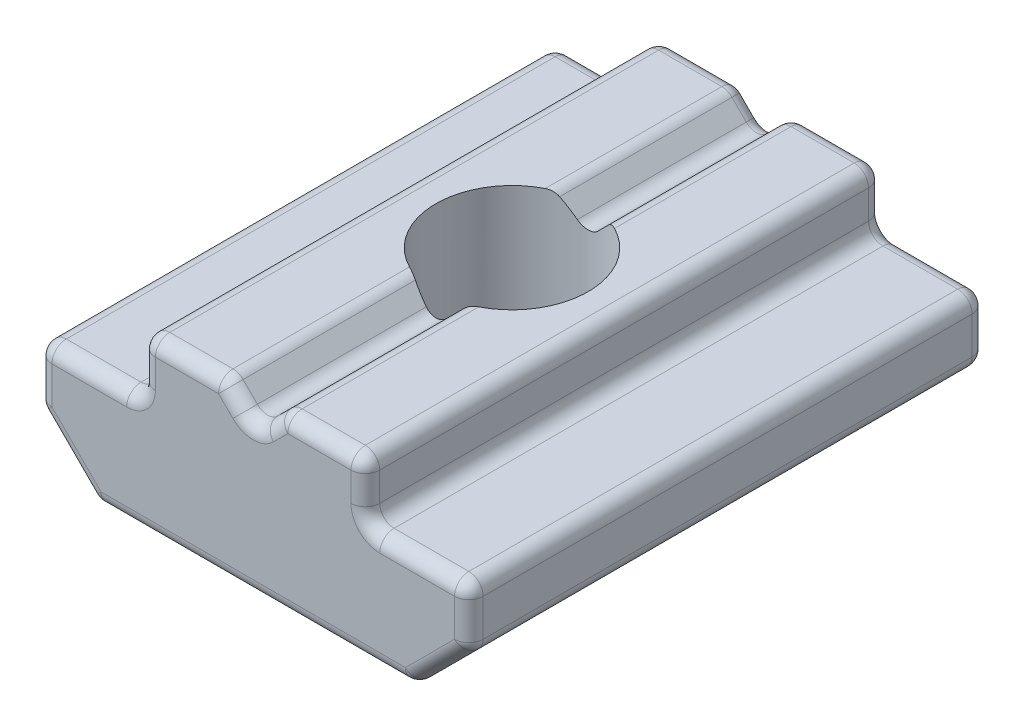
ISO-10303-21;
HEADER;
FILE_DESCRIPTION(('STEP AP214'),'2;1');
FILE_NAME('part.step','',(''),(''),'','','');
FILE_SCHEMA(('AUTOMOTIVE_DESIGN { 1 0 10303 214 1 1 1 1 }'));
ENDSEC;
DATA;
#1=APPLICATION_CONTEXT('core data for automotive mechanical design processes');
#2=APPLICATION_PROTOCOL_DEFINITION('international standard','automotive_design',2000,#1);
#3=PRODUCT_CONTEXT('',#1,'mechanical');
#4=PRODUCT('Part','Part','',(#3));
#5=PRODUCT_RELATED_PRODUCT_CATEGORY('part','',(#4));
#6=PRODUCT_DEFINITION_FORMATION('','',#4);
#7=PRODUCT_DEFINITION_CONTEXT('part definition',#1,'design');
#8=PRODUCT_DEFINITION('design','',#6,#7);
#9=PRODUCT_DEFINITION_SHAPE('','',#8);
#10=(LENGTH_UNIT() NAMED_UNIT(*) SI_UNIT(.MILLI.,.METRE.));
#11=(NAMED_UNIT(*) PLANE_ANGLE_UNIT() SI_UNIT($,.RADIAN.));
#12=(NAMED_UNIT(*) SI_UNIT($,.STERADIAN.) SOLID_ANGLE_UNIT());
#13=UNCERTAINTY_MEASURE_WITH_UNIT(LENGTH_MEASURE(1.E-05),#10,'distance_accuracy_value','');
#14=(GEOMETRIC_REPRESENTATION_CONTEXT(3) GLOBAL_UNCERTAINTY_ASSIGNED_CONTEXT((#13)) GLOBAL_UNIT_ASSIGNED_CONTEXT((#10,
#11,#12)) REPRESENTATION_CONTEXT('',''));
#15=CARTESIAN_POINT('',(0.,0.,0.));
#16=DIRECTION('',(0.,0.,1.));
#17=DIRECTION('',(1.,0.,0.));
#18=AXIS2_PLACEMENT_3D('',#15,#16,#17);
#19=CARTESIAN_POINT('',(0.997020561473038,2.99999998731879,18.));
#20=DIRECTION('',(0.707106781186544,-0.707106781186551,0.));
#21=DIRECTION('',(0.707106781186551,0.707106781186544,0.));
#22=AXIS2_PLACEMENT_3D('',#19,#20,#21);
#23=PLANE('',#22);
#24=DIRECTION('',(0.,0.,-1.));
#25=VECTOR('',#24,1.);
#26=CARTESIAN_POINT('',(0.353553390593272,2.35653281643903,18.));
#27=LINE('',#26,#25);
#28=CARTESIAN_POINT('',(0.353553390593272,2.35653281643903,0.5));
#29=VERTEX_POINT('',#28);
#30=CARTESIAN_POINT('',(0.353553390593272,2.35653281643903,6.37369080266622));
#31=VERTEX_POINT('',#30);
#32=EDGE_CURVE('E807',#29,#31,#27,.F.);
#33=ORIENTED_EDGE('',*,*,#32,.T.);
#34=CARTESIAN_POINT('',(0.,2.00297942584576,9.));
#35=DIRECTION('',(0.707106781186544,-0.707106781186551,0.));
#36=DIRECTION('',(-0.707106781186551,-0.707106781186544,0.));
#37=AXIS2_PLACEMENT_3D('',#34,#35,#36);
#38=ELLIPSE('',#37,3.74766594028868,2.65);
#39=CARTESIAN_POINT('',(0.850573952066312,2.85355337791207,6.49021436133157));
#40=VERTEX_POINT('',#39);
#41=EDGE_CURVE('E1027',#31,#40,#38,.T.);
#42=ORIENTED_EDGE('',*,*,#41,.T.);
#43=DIRECTION('',(0.,0.,-1.));
#44=VECTOR('',#43,1.);
#45=CARTESIAN_POINT('',(0.850573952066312,2.85355337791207,18.));
#46=LINE('',#45,#44);
#47=CARTESIAN_POINT('',(0.850573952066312,2.85355337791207,0.5));
#48=VERTEX_POINT('',#47);
#49=EDGE_CURVE('E365',#40,#48,#46,.T.);
#50=ORIENTED_EDGE('',*,*,#49,.T.);
#51=DIRECTION('',(-0.707106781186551,-0.707106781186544,0.));
#52=VECTOR('',#51,1.);
#53=CARTESIAN_POINT('',(0.997020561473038,2.99999998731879,0.5));
#54=LINE('',#53,#52);
#55=EDGE_CURVE('E804',#48,#29,#54,.T.);
#56=ORIENTED_EDGE('',*,*,#55,.T.);
#57=EDGE_LOOP('',(#33,#42,#50,#56));
#58=FACE_BOUND('',#57,.T.);
#59=ADVANCED_FACE('F34',(#58),#23,.F.);
#60=CARTESIAN_POINT('',(-0.997020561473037,2.99999998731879,18.));
#61=DIRECTION('',(-0.707106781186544,-0.707106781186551,0.));
#62=DIRECTION('',(0.707106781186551,-0.707106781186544,0.));
#63=AXIS2_PLACEMENT_3D('',#60,#61,#62);
#64=PLANE('',#63);
#65=DIRECTION('',(0.,0.,-1.));
#66=VECTOR('',#65,1.);
#67=CARTESIAN_POINT('',(-0.353553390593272,2.35653281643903,0.));
#68=LINE('',#67,#66);
#69=CARTESIAN_POINT('',(-0.353553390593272,2.35653281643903,17.5));
#70=VERTEX_POINT('',#69);
#71=CARTESIAN_POINT('',(-0.353553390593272,2.35653281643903,11.6263091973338));
#72=VERTEX_POINT('',#71);
#73=EDGE_CURVE('E812',#70,#72,#68,.T.);
#74=ORIENTED_EDGE('',*,*,#73,.T.);
#75=CARTESIAN_POINT('',(0.,2.00297942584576,9.));
#76=DIRECTION('',(-0.707106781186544,-0.707106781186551,0.));
#77=DIRECTION('',(0.707106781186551,-0.707106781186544,0.));
#78=AXIS2_PLACEMENT_3D('',#75,#76,#77);
#79=ELLIPSE('',#78,3.74766594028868,2.65);
#80=CARTESIAN_POINT('',(-0.850573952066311,2.85355337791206,11.5097856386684));
#81=VERTEX_POINT('',#80);
#82=EDGE_CURVE('E718',#72,#81,#79,.T.);
#83=ORIENTED_EDGE('',*,*,#82,.T.);
#84=DIRECTION('',(0.,0.,-1.));
#85=VECTOR('',#84,1.);
#86=CARTESIAN_POINT('',(-0.850573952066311,2.85355337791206,18.));
#87=LINE('',#86,#85);
#88=CARTESIAN_POINT('',(-0.850573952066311,2.85355337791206,17.5));
#89=VERTEX_POINT('',#88);
#90=EDGE_CURVE('E824',#81,#89,#87,.F.);
#91=ORIENTED_EDGE('',*,*,#90,.T.);
#92=DIRECTION('',(-0.707106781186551,0.707106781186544,0.));
#93=VECTOR('',#92,1.);
#94=CARTESIAN_POINT('',(0.,2.00297942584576,17.5));
#95=LINE('',#94,#93);
#96=EDGE_CURVE('E819',#89,#70,#95,.F.);
#97=ORIENTED_EDGE('',*,*,#96,.T.);
#98=EDGE_LOOP('',(#74,#83,#91,#97));
#99=FACE_BOUND('',#98,.T.);
#100=ADVANCED_FACE('F775',(#99),#64,.F.);
#101=CARTESIAN_POINT('',(1.20412734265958,2.49999998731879,18.));
#102=DIRECTION('',(0.,0.,-1.));
#103=DIRECTION('',(-1.,0.,0.));
#104=AXIS2_PLACEMENT_3D('',#101,#102,#103);
#105=CYLINDRICAL_SURFACE('',#104,0.5);
#106=CARTESIAN_POINT('',(1.20412734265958,2.99999998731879,6.63936929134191));
#107=CARTESIAN_POINT('',(1.17572561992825,3.0000250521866,6.62485592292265));
#108=CARTESIAN_POINT('',(1.1469993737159,2.99757922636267,6.61087464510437));
#109=CARTESIAN_POINT('',(1.08964823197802,2.98758620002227,6.58418964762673));
#110=CARTESIAN_POINT('',(1.06102481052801,2.98001044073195,6.57149353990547));
#111=CARTESIAN_POINT('',(1.004870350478,2.95955857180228,6.54771991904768));
#112=CARTESIAN_POINT('',(0.977343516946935,2.94666387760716,6.53664826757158));
#113=CARTESIAN_POINT('',(0.924704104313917,2.91574809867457,6.51641177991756));
#114=CARTESIAN_POINT('',(0.899581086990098,2.89775066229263,6.50723847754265));
#115=CARTESIAN_POINT('',(0.867394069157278,2.86979537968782,6.4959597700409));
#116=CARTESIAN_POINT('',(0.85884633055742,2.86183162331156,6.49301677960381));
#117=CARTESIAN_POINT('',(0.850573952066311,2.85355337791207,6.49021436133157));
#118=B_SPLINE_CURVE_WITH_KNOTS('',3,(#106,#107,#108,#109,#110,#111,#112,#113,#114,#115,#116,
#117),.UNSPECIFIED.,.F.,.F.,(4,2,2,2,2,4),(0.,0.0956583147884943,0.191853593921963,
0.288387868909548,0.384481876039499,0.420593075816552),.UNSPECIFIED.);
#119=CARTESIAN_POINT('',(1.20412734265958,2.99999998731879,6.63936929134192));
#120=VERTEX_POINT('',#119);
#121=EDGE_CURVE('E347',#120,#40,#118,.T.);
#122=ORIENTED_EDGE('',*,*,#121,.F.);
#123=DIRECTION('',(0.,0.,-1.));
#124=VECTOR('',#123,1.);
#125=CARTESIAN_POINT('',(1.20412734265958,2.99999998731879,18.));
#126=LINE('',#125,#124);
#127=CARTESIAN_POINT('',(1.20412734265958,2.99999998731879,0.5));
#128=VERTEX_POINT('',#127);
#129=EDGE_CURVE('E363',#128,#120,#126,.F.);
#130=ORIENTED_EDGE('',*,*,#129,.F.);
#131=CARTESIAN_POINT('',(1.20412734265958,2.49999998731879,0.5));
#132=DIRECTION('',(0.,0.,-1.));
#133=DIRECTION('',(-1.,0.,0.));
#134=AXIS2_PLACEMENT_3D('',#131,#132,#133);
#135=CIRCLE('',#134,0.5);
#136=EDGE_CURVE('E662',#48,#128,#135,.T.);
#137=ORIENTED_EDGE('',*,*,#136,.F.);
#138=ORIENTED_EDGE('',*,*,#49,.F.);
#139=EDGE_LOOP('',(#122,#130,#137,#138));
#140=FACE_BOUND('',#139,.T.);
#141=ADVANCED_FACE('F361',(#140),#105,.T.);
#142=CARTESIAN_POINT('',(-1.20412734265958,2.49999998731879,18.));
#143=DIRECTION('',(0.,0.,-1.));
#144=DIRECTION('',(-1.,0.,0.));
#145=AXIS2_PLACEMENT_3D('',#142,#143,#144);
#146=CYLINDRICAL_SURFACE('',#145,0.5);
#147=CARTESIAN_POINT('',(-0.850573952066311,2.85355337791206,6.49021436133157));
#148=CARTESIAN_POINT('',(-0.870919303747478,2.87394185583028,6.49709673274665));
#149=CARTESIAN_POINT('',(-0.892890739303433,2.89235599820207,6.5048299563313));
#150=CARTESIAN_POINT('',(-0.939130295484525,2.92492902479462,6.52187143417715));
#151=CARTESIAN_POINT('',(-0.963390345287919,2.93910217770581,6.53117423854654));
#152=CARTESIAN_POINT('',(-1.01337439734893,2.96301554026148,6.55126527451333));
#153=CARTESIAN_POINT('',(-1.03909675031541,2.97276063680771,6.56205185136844));
#154=CARTESIAN_POINT('',(-1.09123581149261,2.98784294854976,6.58494050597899));
#155=CARTESIAN_POINT('',(-1.11765240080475,2.99318091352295,6.59704235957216));
#156=CARTESIAN_POINT('',(-1.15409074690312,2.99759348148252,6.61448118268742));
#157=CARTESIAN_POINT('',(-1.16413742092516,2.99849977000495,6.61936781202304));
#158=CARTESIAN_POINT('',(-1.18417475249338,2.99970203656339,6.62927133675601));
#159=CARTESIAN_POINT('',(-1.19416548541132,2.99999939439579,6.63428791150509));
#160=CARTESIAN_POINT('',(-1.20412734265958,2.99999998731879,6.63936929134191));
#161=B_SPLINE_CURVE_WITH_KNOTS('',3,(#147,#148,#149,#150,#151,#152,#153,#154,#155,#156,#157,
#158,#159,#160),.UNSPECIFIED.,.F.,.F.,(4,2,2,2,2,2,4),(0.,0.0886619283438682,0.177022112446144,
0.26528454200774,0.353531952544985,0.387145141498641,0.420682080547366),.UNSPECIFIED.);
#162=CARTESIAN_POINT('',(-0.850573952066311,2.85355337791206,6.49021436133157));
#163=VERTEX_POINT('',#162);
#164=CARTESIAN_POINT('',(-1.20412734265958,2.99999998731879,6.63936929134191));
#165=VERTEX_POINT('',#164);
#166=EDGE_CURVE('E55',#163,#165,#161,.T.);
#167=ORIENTED_EDGE('',*,*,#166,.F.);
#168=CARTESIAN_POINT('',(-0.850573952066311,2.85355337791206,0.5));
#169=VERTEX_POINT('',#168);
#170=EDGE_CURVE('E821',#169,#163,#87,.F.);
#171=ORIENTED_EDGE('',*,*,#170,.F.);
#172=CARTESIAN_POINT('',(-1.20412734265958,2.49999998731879,0.5));
#173=DIRECTION('',(0.,0.,-1.));
#174=DIRECTION('',(-1.,0.,0.));
#175=AXIS2_PLACEMENT_3D('',#172,#173,#174);
#176=CIRCLE('',#175,0.5);
#177=CARTESIAN_POINT('',(-1.20412734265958,2.99999998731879,0.5));
#178=VERTEX_POINT('',#177);
#179=EDGE_CURVE('E606',#178,#169,#176,.T.);
#180=ORIENTED_EDGE('',*,*,#179,.F.);
#181=DIRECTION('',(0.,0.,-1.));
#182=VECTOR('',#181,1.);
#183=CARTESIAN_POINT('',(-1.20412734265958,2.99999998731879,18.));
#184=LINE('',#183,#182);
#185=EDGE_CURVE('E828',#165,#178,#184,.T.);
#186=ORIENTED_EDGE('',*,*,#185,.F.);
#187=EDGE_LOOP('',(#167,#171,#180,#186));
#188=FACE_BOUND('',#187,.T.);
#189=ADVANCED_FACE('F732',(#188),#146,.T.);
#190=CARTESIAN_POINT('',(0.,2.71008620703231,18.));
#191=DIRECTION('',(0.,0.,1.));
#192=DIRECTION('',(1.,0.,0.));
#193=AXIS2_PLACEMENT_3D('',#190,#191,#192);
#194=CYLINDRICAL_SURFACE('',#193,0.5);
#195=CARTESIAN_POINT('',(0.353553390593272,2.35653281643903,11.6263091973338));
#196=VERTEX_POINT('',#195);
#197=CARTESIAN_POINT('',(0.353553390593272,2.35653281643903,17.5));
#198=VERTEX_POINT('',#197);
#199=EDGE_CURVE('E811',#196,#198,#27,.F.);
#200=ORIENTED_EDGE('',*,*,#199,.F.);
#201=CARTESIAN_POINT('',(0.353553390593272,2.35653281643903,11.6263091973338));
#202=CARTESIAN_POINT('',(0.33374590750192,2.33669489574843,11.6289833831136));
#203=CARTESIAN_POINT('',(0.312242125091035,2.31855415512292,11.6316432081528));
#204=CARTESIAN_POINT('',(0.266489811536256,2.28610041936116,11.6366648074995));
#205=CARTESIAN_POINT('',(0.242241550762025,2.27178704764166,11.6390266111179));
#206=CARTESIAN_POINT('',(0.191623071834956,2.24740729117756,11.6431851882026));
#207=CARTESIAN_POINT('',(0.165251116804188,2.23734442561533,11.6449814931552));
#208=CARTESIAN_POINT('',(0.111163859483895,2.22178961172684,11.6478055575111));
#209=CARTESIAN_POINT('',(0.0834491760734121,2.21629557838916,11.6488336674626));
#210=CARTESIAN_POINT('',(0.0277878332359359,2.21008288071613,11.6499988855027));
#211=CARTESIAN_POINT('',(-0.000152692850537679,2.20931110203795,11.6501459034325));
#212=CARTESIAN_POINT('',(-0.0557687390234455,2.21242613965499,11.64955906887));
#213=CARTESIAN_POINT('',(-0.0834442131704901,2.21631374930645,11.648825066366));
#214=CARTESIAN_POINT('',(-0.137533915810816,2.22857988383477,11.6465662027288));
#215=CARTESIAN_POINT('',(-0.163955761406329,2.2369260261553,11.6450470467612));
#216=CARTESIAN_POINT('',(-0.215021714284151,2.25784049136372,11.641386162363));
#217=CARTESIAN_POINT('',(-0.239666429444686,2.27040736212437,11.6392446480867));
#218=CARTESIAN_POINT('',(-0.279502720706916,2.29505419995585,11.6352706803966));
#219=CARTESIAN_POINT('',(-0.295318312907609,2.30615731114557,11.6335371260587));
#220=CARTESIAN_POINT('',(-0.325534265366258,2.33008776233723,11.6299733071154));
#221=CARTESIAN_POINT('',(-0.339936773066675,2.34291241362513,11.6281431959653));
#222=CARTESIAN_POINT('',(-0.353553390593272,2.35653281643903,11.6263091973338));
#223=B_SPLINE_CURVE_WITH_KNOTS('',3,(#201,#202,#203,#204,#205,#206,#207,#208,#209,#210,#211,
#212,#213,#214,#215,#216,#217,#218,#219,#220,#221,#222),.UNSPECIFIED.,.F.,.F.,(4,2,2,2,2,2,2,2,
2,2,4),(0.,0.0843803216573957,0.168752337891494,0.253194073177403,0.337597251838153,
0.421049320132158,0.504515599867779,0.587383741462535,0.670223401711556,0.728306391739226,
0.786299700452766),.UNSPECIFIED.);
#224=EDGE_CURVE('E11',#196,#72,#223,.T.);
#225=ORIENTED_EDGE('',*,*,#224,.T.);
#226=ORIENTED_EDGE('',*,*,#73,.F.);
#227=CARTESIAN_POINT('',(0.,2.71008620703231,17.5));
#228=DIRECTION('',(0.,0.,1.));
#229=DIRECTION('',(1.,0.,0.));
#230=AXIS2_PLACEMENT_3D('',#227,#228,#229);
#231=CIRCLE('',#230,0.5);
#232=EDGE_CURVE('E656',#70,#198,#231,.T.);
#233=ORIENTED_EDGE('',*,*,#232,.T.);
#234=EDGE_LOOP('',(#200,#225,#226,#233));
#235=FACE_BOUND('',#234,.T.);
#236=ADVANCED_FACE('F773',(#235),#194,.F.);
#237=CARTESIAN_POINT('',(0.,0.,18.));
#238=DIRECTION('',(0.,0.,1.));
#239=DIRECTION('',(1.,0.,0.));
#240=AXIS2_PLACEMENT_3D('',#237,#238,#239);
#241=PLANE('',#240);
#242=CARTESIAN_POINT('',(4.39999998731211,1.49999998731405,18.));
#243=DIRECTION('',(0.,0.,1.));
#244=DIRECTION('',(1.,0.,0.));
#245=AXIS2_PLACEMENT_3D('',#242,#243,#244);
#246=CIRCLE('',#245,1.);
#247=CARTESIAN_POINT('',(3.39999998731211,1.49999998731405,18.));
#248=VERTEX_POINT('',#247);
#249=CARTESIAN_POINT('',(4.39999998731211,0.49999998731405,18.));
#250=VERTEX_POINT('',#249);
#251=EDGE_CURVE('E63',#248,#250,#246,.T.);
#252=ORIENTED_EDGE('',*,*,#251,.F.);
#253=DIRECTION('',(0.,1.,0.));
#254=VECTOR('',#253,1.);
#255=CARTESIAN_POINT('',(3.39999998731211,2.99999998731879,18.));
#256=LINE('',#255,#254);
#257=CARTESIAN_POINT('',(3.39999998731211,2.49999998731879,18.));
#258=VERTEX_POINT('',#257);
#259=EDGE_CURVE('E458',#248,#258,#256,.T.);
#260=ORIENTED_EDGE('',*,*,#259,.T.);
#261=DIRECTION('',(-1.,0.,0.));
#262=VECTOR('',#261,1.);
#263=CARTESIAN_POINT('',(0.997020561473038,2.49999998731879,18.));
#264=LINE('',#263,#262);
#265=CARTESIAN_POINT('',(1.20412734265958,2.49999998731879,18.));
#266=VERTEX_POINT('',#265);
#267=EDGE_CURVE('E454',#258,#266,#264,.T.);
#268=ORIENTED_EDGE('',*,*,#267,.T.);
#269=DIRECTION('',(-0.707106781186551,-0.707106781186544,0.));
#270=VECTOR('',#269,1.);
#271=CARTESIAN_POINT('',(0.353553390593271,1.64942603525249,18.));
#272=LINE('',#271,#270);
#273=CARTESIAN_POINT('',(0.707106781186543,2.00297942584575,18.));
#274=VERTEX_POINT('',#273);
#275=EDGE_CURVE('E452',#266,#274,#272,.T.);
#276=ORIENTED_EDGE('',*,*,#275,.T.);
#277=CARTESIAN_POINT('',(0.,2.71008620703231,18.));
#278=DIRECTION('',(0.,0.,1.));
#279=DIRECTION('',(1.,0.,0.));
#280=AXIS2_PLACEMENT_3D('',#277,#278,#279);
#281=CIRCLE('',#280,1.);
#282=CARTESIAN_POINT('',(-0.707106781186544,2.00297942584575,18.));
#283=VERTEX_POINT('',#282);
#284=EDGE_CURVE('E449',#283,#274,#281,.T.);
#285=ORIENTED_EDGE('',*,*,#284,.F.);
#286=DIRECTION('',(-0.707106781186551,0.707106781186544,0.));
#287=VECTOR('',#286,1.);
#288=CARTESIAN_POINT('',(-1.35057395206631,2.64644659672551,18.));
#289=LINE('',#288,#287);
#290=CARTESIAN_POINT('',(-1.20412734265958,2.49999998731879,18.));
#291=VERTEX_POINT('',#290);
#292=EDGE_CURVE('E445',#283,#291,#289,.T.);
#293=ORIENTED_EDGE('',*,*,#292,.T.);
#294=DIRECTION('',(-1.,0.,0.));
#295=VECTOR('',#294,1.);
#296=CARTESIAN_POINT('',(-3.90000001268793,2.49999998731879,18.));
#297=LINE('',#296,#295);
#298=CARTESIAN_POINT('',(-3.40000001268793,2.49999998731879,18.));
#299=VERTEX_POINT('',#298);
#300=EDGE_CURVE('E443',#291,#299,#297,.T.);
#301=ORIENTED_EDGE('',*,*,#300,.T.);
#302=DIRECTION('',(0.,-1.,0.));
#303=VECTOR('',#302,1.);
#304=CARTESIAN_POINT('',(-3.40000001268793,0.99999998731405,18.));
#305=LINE('',#304,#303);
#306=CARTESIAN_POINT('',(-3.40000001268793,1.49999998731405,18.));
#307=VERTEX_POINT('',#306);
#308=EDGE_CURVE('E432',#299,#307,#305,.T.);
#309=ORIENTED_EDGE('',*,*,#308,.T.);
#310=CARTESIAN_POINT('',(-4.40000001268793,1.49999998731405,18.));
#311=DIRECTION('',(0.,0.,1.));
#312=DIRECTION('',(1.,0.,0.));
#313=AXIS2_PLACEMENT_3D('',#310,#311,#312);
#314=CIRCLE('',#313,1.);
#315=CARTESIAN_POINT('',(-4.40000001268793,0.49999998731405,18.));
#316=VERTEX_POINT('',#315);
#317=EDGE_CURVE('E429',#316,#307,#314,.T.);
#318=ORIENTED_EDGE('',*,*,#317,.F.);
#319=DIRECTION('',(-1.,0.,0.));
#320=VECTOR('',#319,1.);
#321=CARTESIAN_POINT('',(-7.50000001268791,0.49999998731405,18.));
#322=LINE('',#321,#320);
#323=CARTESIAN_POINT('',(-7.00000001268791,0.49999998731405,18.));
#324=VERTEX_POINT('',#323);
#325=EDGE_CURVE('E427',#316,#324,#322,.T.);
#326=ORIENTED_EDGE('',*,*,#325,.T.);
#327=DIRECTION('',(0.,-1.,0.));
#328=VECTOR('',#327,1.);
#329=CARTESIAN_POINT('',(-7.00000001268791,-0.99999998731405,18.));
#330=LINE('',#329,#328);
#331=CARTESIAN_POINT('',(-7.00000001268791,-0.792893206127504,18.));
#332=VERTEX_POINT('',#331);
#333=EDGE_CURVE('E434',#324,#332,#330,.T.);
#334=ORIENTED_EDGE('',*,*,#333,.T.);
#335=DIRECTION('',(0.707106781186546,-0.707106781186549,0.));
#336=VECTOR('',#335,1.);
#337=CARTESIAN_POINT('',(-5.14644660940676,-2.64644660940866,18.));
#338=LINE('',#337,#336);
#339=CARTESIAN_POINT('',(-5.29289321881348,-2.50000000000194,18.));
#340=VERTEX_POINT('',#339);
#341=EDGE_CURVE('E436',#332,#340,#338,.T.);
#342=ORIENTED_EDGE('',*,*,#341,.T.);
#343=DIRECTION('',(1.,0.,0.));
#344=VECTOR('',#343,1.);
#345=CARTESIAN_POINT('',(5.50000000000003,-2.50000000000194,18.));
#346=LINE('',#345,#344);
#347=CARTESIAN_POINT('',(5.29289321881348,-2.50000000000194,18.));
#348=VERTEX_POINT('',#347);
#349=EDGE_CURVE('E438',#340,#348,#346,.T.);
#350=ORIENTED_EDGE('',*,*,#349,.T.);
#351=DIRECTION('',(0.707106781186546,0.707106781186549,0.));
#352=VECTOR('',#351,1.);
#353=CARTESIAN_POINT('',(7.14644662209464,-0.646446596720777,18.));
#354=LINE('',#353,#352);
#355=CARTESIAN_POINT('',(7.00000001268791,-0.792893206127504,18.));
#356=VERTEX_POINT('',#355);
#357=EDGE_CURVE('E440',#348,#356,#354,.T.);
#358=ORIENTED_EDGE('',*,*,#357,.T.);
#359=DIRECTION('',(0.,1.,0.));
#360=VECTOR('',#359,1.);
#361=CARTESIAN_POINT('',(7.00000001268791,0.99999998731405,18.));
#362=LINE('',#361,#360);
#363=CARTESIAN_POINT('',(7.00000001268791,0.49999998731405,18.));
#364=VERTEX_POINT('',#363);
#365=EDGE_CURVE('E447',#356,#364,#362,.T.);
#366=ORIENTED_EDGE('',*,*,#365,.T.);
#367=DIRECTION('',(-1.,0.,0.));
#368=VECTOR('',#367,1.);
#369=CARTESIAN_POINT('',(3.89999998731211,0.49999998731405,18.));
#370=LINE('',#369,#368);
#371=EDGE_CURVE('E456',#364,#250,#370,.T.);
#372=ORIENTED_EDGE('',*,*,#371,.T.);
#373=EDGE_LOOP('',(#252,#260,#268,#276,#285,#293,#301,#309,#318,#326,#334,#342,#350,#358,#366,#372));
#374=FACE_BOUND('',#373,.T.);
#375=ADVANCED_FACE('F693',(#374),#241,.T.);
#376=CARTESIAN_POINT('',(-3.90000001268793,0.99999998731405,18.));
#377=DIRECTION('',(0.,-1.,0.));
#378=DIRECTION('',(1.,0.,0.));
#379=AXIS2_PLACEMENT_3D('',#376,#377,#378);
#380=PLANE('',#379);
#381=DIRECTION('',(-1.,0.,0.));
#382=VECTOR('',#381,1.);
#383=CARTESIAN_POINT('',(-3.90000001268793,0.99999998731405,17.5));
#384=LINE('',#383,#382);
#385=CARTESIAN_POINT('',(-7.00000001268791,0.99999998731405,17.5));
#386=VERTEX_POINT('',#385);
#387=CARTESIAN_POINT('',(-4.40000001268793,0.99999998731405,17.5));
#388=VERTEX_POINT('',#387);
#389=EDGE_CURVE('E850',#386,#388,#384,.F.);
#390=ORIENTED_EDGE('',*,*,#389,.T.);
#391=DIRECTION('',(0.,0.,-1.));
#392=VECTOR('',#391,1.);
#393=CARTESIAN_POINT('',(-4.40000001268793,0.99999998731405,0.));
#394=LINE('',#393,#392);
#395=CARTESIAN_POINT('',(-4.40000001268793,0.99999998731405,0.5));
#396=VERTEX_POINT('',#395);
#397=EDGE_CURVE('E845',#388,#396,#394,.T.);
#398=ORIENTED_EDGE('',*,*,#397,.T.);
#399=DIRECTION('',(-1.,0.,0.));
#400=VECTOR('',#399,1.);
#401=CARTESIAN_POINT('',(-3.90000001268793,0.99999998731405,0.5));
#402=LINE('',#401,#400);
#403=CARTESIAN_POINT('',(-7.00000001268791,0.99999998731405,0.5));
#404=VERTEX_POINT('',#403);
#405=EDGE_CURVE('E847',#396,#404,#402,.T.);
#406=ORIENTED_EDGE('',*,*,#405,.T.);
#407=DIRECTION('',(0.,0.,-1.));
#408=VECTOR('',#407,1.);
#409=CARTESIAN_POINT('',(-7.00000001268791,0.99999998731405,18.));
#410=LINE('',#409,#408);
#411=EDGE_CURVE('E852',#404,#386,#410,.F.);
#412=ORIENTED_EDGE('',*,*,#411,.T.);
#413=EDGE_LOOP('',(#390,#398,#406,#412));
#414=FACE_BOUND('',#413,.T.);
#415=ADVANCED_FACE('F1052',(#414),#380,.F.);
#416=CARTESIAN_POINT('',(-7.50000001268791,0.99999998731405,18.));
#417=DIRECTION('',(1.,0.,0.));
#418=DIRECTION('',(0.,1.,0.));
#419=AXIS2_PLACEMENT_3D('',#416,#417,#418);
#420=PLANE('',#419);
#421=DIRECTION('',(0.,-1.,0.));
#422=VECTOR('',#421,1.);
#423=CARTESIAN_POINT('',(-7.50000001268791,0.99999998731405,0.5));
#424=LINE('',#423,#422);
#425=CARTESIAN_POINT('',(-7.50000001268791,0.49999998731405,0.5));
#426=VERTEX_POINT('',#425);
#427=CARTESIAN_POINT('',(-7.50000001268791,-0.792893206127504,0.5));
#428=VERTEX_POINT('',#427);
#429=EDGE_CURVE('E856',#426,#428,#424,.T.);
#430=ORIENTED_EDGE('',*,*,#429,.T.);
#431=DIRECTION('',(0.,0.,-1.));
#432=VECTOR('',#431,1.);
#433=CARTESIAN_POINT('',(-7.50000001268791,-0.792893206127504,18.));
#434=LINE('',#433,#432);
#435=CARTESIAN_POINT('',(-7.50000001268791,-0.792893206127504,17.5));
#436=VERTEX_POINT('',#435);
#437=EDGE_CURVE('E854',#428,#436,#434,.F.);
#438=ORIENTED_EDGE('',*,*,#437,.T.);
#439=DIRECTION('',(0.,-1.,0.));
#440=VECTOR('',#439,1.);
#441=CARTESIAN_POINT('',(-7.50000001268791,0.99999998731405,17.5));
#442=LINE('',#441,#440);
#443=CARTESIAN_POINT('',(-7.50000001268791,0.49999998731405,17.5));
#444=VERTEX_POINT('',#443);
#445=EDGE_CURVE('E859',#436,#444,#442,.F.);
#446=ORIENTED_EDGE('',*,*,#445,.T.);
#447=DIRECTION('',(0.,0.,-1.));
#448=VECTOR('',#447,1.);
#449=CARTESIAN_POINT('',(-7.50000001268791,0.49999998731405,18.));
#450=LINE('',#449,#448);
#451=EDGE_CURVE('E861',#444,#426,#450,.T.);
#452=ORIENTED_EDGE('',*,*,#451,.T.);
#453=EDGE_LOOP('',(#430,#438,#446,#452));
#454=FACE_BOUND('',#453,.T.);
#455=ADVANCED_FACE('F1046',(#454),#420,.F.);
#456=CARTESIAN_POINT('',(-7.50000001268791,-0.99999998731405,18.));
#457=DIRECTION('',(0.707106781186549,0.707106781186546,0.));
#458=DIRECTION('',(-0.707106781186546,0.707106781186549,0.));
#459=AXIS2_PLACEMENT_3D('',#456,#457,#458);
#460=PLANE('',#459);
#461=DIRECTION('',(0.707106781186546,-0.707106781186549,0.));
#462=VECTOR('',#461,1.);
#463=CARTESIAN_POINT('',(-7.50000001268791,-0.999999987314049,17.5));
#464=LINE('',#463,#462);
#465=CARTESIAN_POINT('',(-5.64644660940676,-2.85355339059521,17.5));
#466=VERTEX_POINT('',#465);
#467=CARTESIAN_POINT('',(-7.35355340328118,-1.14644659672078,17.5));
#468=VERTEX_POINT('',#467);
#469=EDGE_CURVE('E904',#466,#468,#464,.F.);
#470=ORIENTED_EDGE('',*,*,#469,.T.);
#471=DIRECTION('',(0.,0.,-1.));
#472=VECTOR('',#471,1.);
#473=CARTESIAN_POINT('',(-7.35355340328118,-1.14644659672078,18.));
#474=LINE('',#473,#472);
#475=CARTESIAN_POINT('',(-7.35355340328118,-1.14644659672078,0.5));
#476=VERTEX_POINT('',#475);
#477=EDGE_CURVE('E899',#468,#476,#474,.T.);
#478=ORIENTED_EDGE('',*,*,#477,.T.);
#479=DIRECTION('',(0.707106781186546,-0.707106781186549,0.));
#480=VECTOR('',#479,1.);
#481=CARTESIAN_POINT('',(-7.50000001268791,-0.99999998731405,0.5));
#482=LINE('',#481,#480);
#483=CARTESIAN_POINT('',(-5.64644660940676,-2.85355339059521,0.5));
#484=VERTEX_POINT('',#483);
#485=EDGE_CURVE('E901',#476,#484,#482,.T.);
#486=ORIENTED_EDGE('',*,*,#485,.T.);
#487=DIRECTION('',(0.,0.,-1.));
#488=VECTOR('',#487,1.);
#489=CARTESIAN_POINT('',(-5.64644660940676,-2.85355339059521,18.));
#490=LINE('',#489,#488);
#491=EDGE_CURVE('E679',#484,#466,#490,.F.);
#492=ORIENTED_EDGE('',*,*,#491,.T.);
#493=EDGE_LOOP('',(#470,#478,#486,#492));
#494=FACE_BOUND('',#493,.T.);
#495=ADVANCED_FACE('F908',(#494),#460,.F.);
#496=CARTESIAN_POINT('',(-5.50000000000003,-3.00000000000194,18.));
#497=DIRECTION('',(0.,1.,0.));
#498=DIRECTION('',(-1.,0.,0.));
#499=AXIS2_PLACEMENT_3D('',#496,#497,#498);
#500=PLANE('',#499);
#501=CARTESIAN_POINT('',(0.,-3.00000000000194,9.));
#502=DIRECTION('',(0.,-1.,0.));
#503=DIRECTION('',(0.,0.,-1.));
#504=AXIS2_PLACEMENT_3D('',#501,#502,#503);
#505=CIRCLE('',#504,2.65);
#506=CARTESIAN_POINT('',(0.,-3.00000000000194,6.35));
#507=VERTEX_POINT('',#506);
#508=EDGE_CURVE('E355',#507,#507,#505,.T.);
#509=ORIENTED_EDGE('',*,*,#508,.F.);
#510=EDGE_LOOP('',(#509));
#511=FACE_BOUND('',#510,.T.);
#512=DIRECTION('',(1.,0.,0.));
#513=VECTOR('',#512,1.);
#514=CARTESIAN_POINT('',(-5.50000000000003,-3.00000000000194,17.5));
#515=LINE('',#514,#513);
#516=CARTESIAN_POINT('',(5.29289321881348,-3.00000000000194,17.5));
#517=VERTEX_POINT('',#516);
#518=CARTESIAN_POINT('',(-5.29289321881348,-3.00000000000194,17.5));
#519=VERTEX_POINT('',#518);
#520=EDGE_CURVE('E420',#517,#519,#515,.F.);
#521=ORIENTED_EDGE('',*,*,#520,.T.);
#522=DIRECTION('',(0.,0.,-1.));
#523=VECTOR('',#522,1.);
#524=CARTESIAN_POINT('',(-5.29289321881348,-3.00000000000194,18.));
#525=LINE('',#524,#523);
#526=CARTESIAN_POINT('',(-5.29289321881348,-3.00000000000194,0.5));
#527=VERTEX_POINT('',#526);
#528=EDGE_CURVE('E425',#519,#527,#525,.T.);
#529=ORIENTED_EDGE('',*,*,#528,.T.);
#530=DIRECTION('',(1.,0.,0.));
#531=VECTOR('',#530,1.);
#532=CARTESIAN_POINT('',(-5.50000000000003,-3.00000000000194,0.5));
#533=LINE('',#532,#531);
#534=CARTESIAN_POINT('',(5.29289321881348,-3.00000000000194,0.5));
#535=VERTEX_POINT('',#534);
#536=EDGE_CURVE('E422',#527,#535,#533,.T.);
#537=ORIENTED_EDGE('',*,*,#536,.T.);
#538=DIRECTION('',(0.,0.,-1.));
#539=VECTOR('',#538,1.);
#540=CARTESIAN_POINT('',(5.29289321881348,-3.00000000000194,18.));
#541=LINE('',#540,#539);
#542=EDGE_CURVE('E418',#535,#517,#541,.F.);
#543=ORIENTED_EDGE('',*,*,#542,.T.);
#544=EDGE_LOOP('',(#521,#529,#537,#543));
#545=FACE_BOUND('',#544,.T.);
#546=ADVANCED_FACE('F926',(#511,#545),#500,.F.);
#547=CARTESIAN_POINT('',(5.50000000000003,-3.00000000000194,18.));
#548=DIRECTION('',(-0.707106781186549,0.707106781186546,0.));
#549=DIRECTION('',(-0.707106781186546,-0.707106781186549,0.));
#550=AXIS2_PLACEMENT_3D('',#547,#548,#549);
#551=PLANE('',#550);
#552=DIRECTION('',(0.707106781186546,0.707106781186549,0.));
#553=VECTOR('',#552,1.);
#554=CARTESIAN_POINT('',(5.50000000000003,-3.00000000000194,17.5));
#555=LINE('',#554,#553);
#556=CARTESIAN_POINT('',(7.35355340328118,-1.14644659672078,17.5));
#557=VERTEX_POINT('',#556);
#558=CARTESIAN_POINT('',(5.64644660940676,-2.85355339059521,17.5));
#559=VERTEX_POINT('',#558);
#560=EDGE_CURVE('E411',#557,#559,#555,.F.);
#561=ORIENTED_EDGE('',*,*,#560,.T.);
#562=DIRECTION('',(0.,0.,-1.));
#563=VECTOR('',#562,1.);
#564=CARTESIAN_POINT('',(5.64644660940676,-2.85355339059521,18.));
#565=LINE('',#564,#563);
#566=CARTESIAN_POINT('',(5.64644660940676,-2.85355339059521,0.5));
#567=VERTEX_POINT('',#566);
#568=EDGE_CURVE('E416',#559,#567,#565,.T.);
#569=ORIENTED_EDGE('',*,*,#568,.T.);
#570=DIRECTION('',(0.707106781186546,0.707106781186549,0.));
#571=VECTOR('',#570,1.);
#572=CARTESIAN_POINT('',(5.50000000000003,-3.00000000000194,0.5));
#573=LINE('',#572,#571);
#574=CARTESIAN_POINT('',(7.35355340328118,-1.14644659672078,0.5));
#575=VERTEX_POINT('',#574);
#576=EDGE_CURVE('E413',#567,#575,#573,.T.);
#577=ORIENTED_EDGE('',*,*,#576,.T.);
#578=DIRECTION('',(0.,0.,-1.));
#579=VECTOR('',#578,1.);
#580=CARTESIAN_POINT('',(7.35355340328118,-1.14644659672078,18.));
#581=LINE('',#580,#579);
#582=EDGE_CURVE('E409',#575,#557,#581,.F.);
#583=ORIENTED_EDGE('',*,*,#582,.T.);
#584=EDGE_LOOP('',(#561,#569,#577,#583));
#585=FACE_BOUND('',#584,.T.);
#586=ADVANCED_FACE('F1037',(#585),#551,.F.);
#587=CARTESIAN_POINT('',(7.50000001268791,-0.99999998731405,18.));
#588=DIRECTION('',(-1.,0.,0.));
#589=DIRECTION('',(0.,0.,1.));
#590=AXIS2_PLACEMENT_3D('',#587,#588,#589);
#591=PLANE('',#590);
#592=DIRECTION('',(0.,1.,0.));
#593=VECTOR('',#592,1.);
#594=CARTESIAN_POINT('',(7.50000001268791,-0.99999998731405,17.5));
#595=LINE('',#594,#593);
#596=CARTESIAN_POINT('',(7.50000001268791,0.49999998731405,17.5));
#597=VERTEX_POINT('',#596);
#598=CARTESIAN_POINT('',(7.50000001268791,-0.792893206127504,17.5));
#599=VERTEX_POINT('',#598);
#600=EDGE_CURVE('E402',#597,#599,#595,.F.);
#601=ORIENTED_EDGE('',*,*,#600,.T.);
#602=DIRECTION('',(0.,0.,-1.));
#603=VECTOR('',#602,1.);
#604=CARTESIAN_POINT('',(7.50000001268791,-0.792893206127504,18.));
#605=LINE('',#604,#603);
#606=CARTESIAN_POINT('',(7.50000001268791,-0.792893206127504,0.5));
#607=VERTEX_POINT('',#606);
#608=EDGE_CURVE('E407',#599,#607,#605,.T.);
#609=ORIENTED_EDGE('',*,*,#608,.T.);
#610=DIRECTION('',(0.,1.,0.));
#611=VECTOR('',#610,1.);
#612=CARTESIAN_POINT('',(7.50000001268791,-0.99999998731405,0.5));
#613=LINE('',#612,#611);
#614=CARTESIAN_POINT('',(7.50000001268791,0.49999998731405,0.5));
#615=VERTEX_POINT('',#614);
#616=EDGE_CURVE('E404',#607,#615,#613,.T.);
#617=ORIENTED_EDGE('',*,*,#616,.T.);
#618=DIRECTION('',(0.,0.,-1.));
#619=VECTOR('',#618,1.);
#620=CARTESIAN_POINT('',(7.50000001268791,0.49999998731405,18.));
#621=LINE('',#620,#619);
#622=EDGE_CURVE('E400',#615,#597,#621,.F.);
#623=ORIENTED_EDGE('',*,*,#622,.T.);
#624=EDGE_LOOP('',(#601,#609,#617,#623));
#625=FACE_BOUND('',#624,.T.);
#626=ADVANCED_FACE('F1043',(#625),#591,.F.);
#627=CARTESIAN_POINT('',(3.89999998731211,0.99999998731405,18.));
#628=DIRECTION('',(0.,-1.,0.));
#629=DIRECTION('',(0.,0.,-1.));
#630=AXIS2_PLACEMENT_3D('',#627,#628,#629);
#631=PLANE('',#630);
#632=DIRECTION('',(-1.,0.,0.));
#633=VECTOR('',#632,1.);
#634=CARTESIAN_POINT('',(3.89999998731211,0.99999998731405,0.5));
#635=LINE('',#634,#633);
#636=CARTESIAN_POINT('',(7.00000001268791,0.99999998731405,0.5));
#637=VERTEX_POINT('',#636);
#638=CARTESIAN_POINT('',(4.39999998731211,0.99999998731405,0.5));
#639=VERTEX_POINT('',#638);
#640=EDGE_CURVE('E395',#637,#639,#635,.T.);
#641=ORIENTED_EDGE('',*,*,#640,.T.);
#642=DIRECTION('',(0.,0.,-1.));
#643=VECTOR('',#642,1.);
#644=CARTESIAN_POINT('',(4.39999998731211,0.99999998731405,18.));
#645=LINE('',#644,#643);
#646=CARTESIAN_POINT('',(4.39999998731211,0.99999998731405,17.5));
#647=VERTEX_POINT('',#646);
#648=EDGE_CURVE('E398',#639,#647,#645,.F.);
#649=ORIENTED_EDGE('',*,*,#648,.T.);
#650=DIRECTION('',(-1.,0.,0.));
#651=VECTOR('',#650,1.);
#652=CARTESIAN_POINT('',(7.50000001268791,0.99999998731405,17.5));
#653=LINE('',#652,#651);
#654=CARTESIAN_POINT('',(7.00000001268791,0.99999998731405,17.5));
#655=VERTEX_POINT('',#654);
#656=EDGE_CURVE('E393',#647,#655,#653,.F.);
#657=ORIENTED_EDGE('',*,*,#656,.T.);
#658=DIRECTION('',(0.,0.,-1.));
#659=VECTOR('',#658,1.);
#660=CARTESIAN_POINT('',(7.00000001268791,0.99999998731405,18.));
#661=LINE('',#660,#659);
#662=EDGE_CURVE('E391',#655,#637,#661,.T.);
#663=ORIENTED_EDGE('',*,*,#662,.T.);
#664=EDGE_LOOP('',(#641,#649,#657,#663));
#665=FACE_BOUND('',#664,.T.);
#666=ADVANCED_FACE('F981',(#665),#631,.F.);
#667=CARTESIAN_POINT('',(3.89999998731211,0.99999998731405,18.));
#668=DIRECTION('',(-1.,0.,0.));
#669=DIRECTION('',(0.,0.,1.));
#670=AXIS2_PLACEMENT_3D('',#667,#668,#669);
#671=PLANE('',#670);
#672=DIRECTION('',(0.,1.,0.));
#673=VECTOR('',#672,1.);
#674=CARTESIAN_POINT('',(3.89999998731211,0.99999998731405,17.5));
#675=LINE('',#674,#673);
#676=CARTESIAN_POINT('',(3.89999998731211,2.49999998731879,17.5));
#677=VERTEX_POINT('',#676);
#678=CARTESIAN_POINT('',(3.89999998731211,1.49999998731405,17.5));
#679=VERTEX_POINT('',#678);
#680=EDGE_CURVE('E384',#677,#679,#675,.F.);
#681=ORIENTED_EDGE('',*,*,#680,.T.);
#682=DIRECTION('',(0.,0.,-1.));
#683=VECTOR('',#682,1.);
#684=CARTESIAN_POINT('',(3.89999998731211,1.49999998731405,0.));
#685=LINE('',#684,#683);
#686=CARTESIAN_POINT('',(3.89999998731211,1.49999998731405,0.5));
#687=VERTEX_POINT('',#686);
#688=EDGE_CURVE('E389',#679,#687,#685,.T.);
#689=ORIENTED_EDGE('',*,*,#688,.T.);
#690=DIRECTION('',(0.,1.,0.));
#691=VECTOR('',#690,1.);
#692=CARTESIAN_POINT('',(3.89999998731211,0.99999998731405,0.5));
#693=LINE('',#692,#691);
#694=CARTESIAN_POINT('',(3.89999998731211,2.49999998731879,0.5));
#695=VERTEX_POINT('',#694);
#696=EDGE_CURVE('E386',#687,#695,#693,.T.);
#697=ORIENTED_EDGE('',*,*,#696,.T.);
#698=DIRECTION('',(0.,0.,-1.));
#699=VECTOR('',#698,1.);
#700=CARTESIAN_POINT('',(3.89999998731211,2.49999998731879,18.));
#701=LINE('',#700,#699);
#702=EDGE_CURVE('E382',#695,#677,#701,.F.);
#703=ORIENTED_EDGE('',*,*,#702,.T.);
#704=EDGE_LOOP('',(#681,#689,#697,#703));
#705=FACE_BOUND('',#704,.T.);
#706=ADVANCED_FACE('F795',(#705),#671,.F.);
#707=CARTESIAN_POINT('',(3.89999998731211,2.99999998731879,18.));
#708=DIRECTION('',(0.,-1.,0.));
#709=DIRECTION('',(1.,0.,0.));
#710=AXIS2_PLACEMENT_3D('',#707,#708,#709);
#711=PLANE('',#710);
#712=ORIENTED_EDGE('',*,*,#129,.T.);
#713=CARTESIAN_POINT('',(0.,2.99999998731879,9.));
#714=DIRECTION('',(0.,-1.,0.));
#715=DIRECTION('',(0.,0.,-1.));
#716=AXIS2_PLACEMENT_3D('',#713,#714,#715);
#717=CIRCLE('',#716,2.65);
#718=CARTESIAN_POINT('',(1.20412734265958,2.99999998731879,11.3606307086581));
#719=VERTEX_POINT('',#718);
#720=EDGE_CURVE('E343',#120,#719,#717,.T.);
#721=ORIENTED_EDGE('',*,*,#720,.T.);
#722=CARTESIAN_POINT('',(1.20412734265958,2.99999998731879,17.5));
#723=VERTEX_POINT('',#722);
#724=EDGE_CURVE('E372',#719,#723,#126,.F.);
#725=ORIENTED_EDGE('',*,*,#724,.T.);
#726=DIRECTION('',(-1.,0.,0.));
#727=VECTOR('',#726,1.);
#728=CARTESIAN_POINT('',(3.89999998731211,2.99999998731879,17.5));
#729=LINE('',#728,#727);
#730=CARTESIAN_POINT('',(3.39999998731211,2.99999998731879,17.5));
#731=VERTEX_POINT('',#730);
#732=EDGE_CURVE('E371',#723,#731,#729,.F.);
#733=ORIENTED_EDGE('',*,*,#732,.T.);
#734=DIRECTION('',(0.,0.,-1.));
#735=VECTOR('',#734,1.);
#736=CARTESIAN_POINT('',(3.39999998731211,2.99999998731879,18.));
#737=LINE('',#736,#735);
#738=CARTESIAN_POINT('',(3.39999998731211,2.99999998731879,0.5));
#739=VERTEX_POINT('',#738);
#740=EDGE_CURVE('E380',#731,#739,#737,.T.);
#741=ORIENTED_EDGE('',*,*,#740,.T.);
#742=DIRECTION('',(-1.,0.,0.));
#743=VECTOR('',#742,1.);
#744=CARTESIAN_POINT('',(3.89999998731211,2.99999998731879,0.5));
#745=LINE('',#744,#743);
#746=EDGE_CURVE('E370',#739,#128,#745,.T.);
#747=ORIENTED_EDGE('',*,*,#746,.T.);
#748=EDGE_LOOP('',(#712,#721,#725,#733,#741,#747));
#749=FACE_BOUND('',#748,.T.);
#750=ADVANCED_FACE('F368',(#749),#711,.F.);
#751=CARTESIAN_POINT('',(0.850573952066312,2.85355337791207,17.5));
#752=VERTEX_POINT('',#751);
#753=CARTESIAN_POINT('',(0.850573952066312,2.85355337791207,11.5097856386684));
#754=VERTEX_POINT('',#753);
#755=EDGE_CURVE('E375',#752,#754,#46,.T.);
#756=ORIENTED_EDGE('',*,*,#755,.T.);
#757=EDGE_CURVE('E799',#754,#196,#38,.T.);
#758=ORIENTED_EDGE('',*,*,#757,.T.);
#759=ORIENTED_EDGE('',*,*,#199,.T.);
#760=DIRECTION('',(-0.707106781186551,-0.707106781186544,0.));
#761=VECTOR('',#760,1.);
#762=CARTESIAN_POINT('',(0.997020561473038,2.99999998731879,17.5));
#763=LINE('',#762,#761);
#764=EDGE_CURVE('E802',#198,#752,#763,.F.);
#765=ORIENTED_EDGE('',*,*,#764,.T.);
#766=EDGE_LOOP('',(#756,#758,#759,#765));
#767=FACE_BOUND('',#766,.T.);
#768=ADVANCED_FACE('F778',(#767),#23,.F.);
#769=ORIENTED_EDGE('',*,*,#170,.T.);
#770=CARTESIAN_POINT('',(-0.353553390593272,2.35653281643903,6.37369080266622));
#771=VERTEX_POINT('',#770);
#772=EDGE_CURVE('E354',#163,#771,#79,.T.);
#773=ORIENTED_EDGE('',*,*,#772,.T.);
#774=CARTESIAN_POINT('',(-0.353553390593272,2.35653281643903,0.5));
#775=VERTEX_POINT('',#774);
#776=EDGE_CURVE('E815',#771,#775,#68,.T.);
#777=ORIENTED_EDGE('',*,*,#776,.T.);
#778=DIRECTION('',(-0.707106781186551,0.707106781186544,0.));
#779=VECTOR('',#778,1.);
#780=CARTESIAN_POINT('',(-0.997020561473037,2.99999998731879,0.5));
#781=LINE('',#780,#779);
#782=EDGE_CURVE('E816',#775,#169,#781,.T.);
#783=ORIENTED_EDGE('',*,*,#782,.T.);
#784=EDGE_LOOP('',(#769,#773,#777,#783));
#785=FACE_BOUND('',#784,.T.);
#786=ADVANCED_FACE('F784',(#785),#64,.F.);
#787=CARTESIAN_POINT('',(-0.997020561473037,2.99999998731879,18.));
#788=DIRECTION('',(0.,-1.,0.));
#789=DIRECTION('',(1.,0.,0.));
#790=AXIS2_PLACEMENT_3D('',#787,#788,#789);
#791=PLANE('',#790);
#792=CARTESIAN_POINT('',(-1.20412734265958,2.99999998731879,17.5));
#793=VERTEX_POINT('',#792);
#794=CARTESIAN_POINT('',(-1.20412734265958,2.99999998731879,11.3606307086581));
#795=VERTEX_POINT('',#794);
#796=EDGE_CURVE('E825',#793,#795,#184,.T.);
#797=ORIENTED_EDGE('',*,*,#796,.T.);
#798=EDGE_CURVE('E357',#795,#165,#717,.T.);
#799=ORIENTED_EDGE('',*,*,#798,.T.);
#800=ORIENTED_EDGE('',*,*,#185,.T.);
#801=DIRECTION('',(-1.,0.,0.));
#802=VECTOR('',#801,1.);
#803=CARTESIAN_POINT('',(-0.997020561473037,2.99999998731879,0.5));
#804=LINE('',#803,#802);
#805=CARTESIAN_POINT('',(-3.40000001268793,2.99999998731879,0.5));
#806=VERTEX_POINT('',#805);
#807=EDGE_CURVE('E829',#178,#806,#804,.T.);
#808=ORIENTED_EDGE('',*,*,#807,.T.);
#809=DIRECTION('',(0.,0.,-1.));
#810=VECTOR('',#809,1.);
#811=CARTESIAN_POINT('',(-3.40000001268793,2.99999998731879,18.));
#812=LINE('',#811,#810);
#813=CARTESIAN_POINT('',(-3.40000001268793,2.99999998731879,17.5));
#814=VERTEX_POINT('',#813);
#815=EDGE_CURVE('E834',#806,#814,#812,.F.);
#816=ORIENTED_EDGE('',*,*,#815,.T.);
#817=DIRECTION('',(-1.,0.,0.));
#818=VECTOR('',#817,1.);
#819=CARTESIAN_POINT('',(-0.997020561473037,2.99999998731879,17.5));
#820=LINE('',#819,#818);
#821=EDGE_CURVE('E832',#814,#793,#820,.F.);
#822=ORIENTED_EDGE('',*,*,#821,.T.);
#823=EDGE_LOOP('',(#797,#799,#800,#808,#816,#822));
#824=FACE_BOUND('',#823,.T.);
#825=ADVANCED_FACE('F793',(#824),#791,.F.);
#826=CARTESIAN_POINT('',(-3.90000001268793,2.99999998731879,18.));
#827=DIRECTION('',(1.,0.,0.));
#828=DIRECTION('',(0.,1.,0.));
#829=AXIS2_PLACEMENT_3D('',#826,#827,#828);
#830=PLANE('',#829);
#831=DIRECTION('',(0.,-1.,0.));
#832=VECTOR('',#831,1.);
#833=CARTESIAN_POINT('',(-3.90000001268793,2.99999998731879,17.5));
#834=LINE('',#833,#832);
#835=CARTESIAN_POINT('',(-3.90000001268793,1.49999998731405,17.5));
#836=VERTEX_POINT('',#835);
#837=CARTESIAN_POINT('',(-3.90000001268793,2.49999998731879,17.5));
#838=VERTEX_POINT('',#837);
#839=EDGE_CURVE('E841',#836,#838,#834,.F.);
#840=ORIENTED_EDGE('',*,*,#839,.T.);
#841=DIRECTION('',(0.,0.,-1.));
#842=VECTOR('',#841,1.);
#843=CARTESIAN_POINT('',(-3.90000001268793,2.49999998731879,18.));
#844=LINE('',#843,#842);
#845=CARTESIAN_POINT('',(-3.90000001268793,2.49999998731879,0.5));
#846=VERTEX_POINT('',#845);
#847=EDGE_CURVE('E836',#838,#846,#844,.T.);
#848=ORIENTED_EDGE('',*,*,#847,.T.);
#849=DIRECTION('',(0.,-1.,0.));
#850=VECTOR('',#849,1.);
#851=CARTESIAN_POINT('',(-3.90000001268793,2.99999998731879,0.5));
#852=LINE('',#851,#850);
#853=CARTESIAN_POINT('',(-3.90000001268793,1.49999998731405,0.5));
#854=VERTEX_POINT('',#853);
#855=EDGE_CURVE('E838',#846,#854,#852,.T.);
#856=ORIENTED_EDGE('',*,*,#855,.T.);
#857=DIRECTION('',(0.,0.,-1.));
#858=VECTOR('',#857,1.);
#859=CARTESIAN_POINT('',(-3.90000001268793,1.49999998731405,18.));
#860=LINE('',#859,#858);
#861=EDGE_CURVE('E843',#854,#836,#860,.F.);
#862=ORIENTED_EDGE('',*,*,#861,.T.);
#863=EDGE_LOOP('',(#840,#848,#856,#862));
#864=FACE_BOUND('',#863,.T.);
#865=ADVANCED_FACE('F1262',(#864),#830,.F.);
#866=CARTESIAN_POINT('',(0.,0.,0.));
#867=DIRECTION('',(0.,0.,1.));
#868=DIRECTION('',(1.,0.,0.));
#869=AXIS2_PLACEMENT_3D('',#866,#867,#868);
#870=PLANE('',#869);
#871=DIRECTION('',(1.,0.,0.));
#872=VECTOR('',#871,1.);
#873=CARTESIAN_POINT('',(0.,-2.50000000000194,0.));
#874=LINE('',#873,#872);
#875=CARTESIAN_POINT('',(5.29289321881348,-2.50000000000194,0.));
#876=VERTEX_POINT('',#875);
#877=CARTESIAN_POINT('',(-5.29289321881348,-2.50000000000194,0.));
#878=VERTEX_POINT('',#877);
#879=EDGE_CURVE('E897',#876,#878,#874,.F.);
#880=ORIENTED_EDGE('',*,*,#879,.T.);
#881=DIRECTION('',(0.707106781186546,-0.707106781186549,0.));
#882=VECTOR('',#881,1.);
#883=CARTESIAN_POINT('',(-3.89644660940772,-3.89644660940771,0.));
#884=LINE('',#883,#882);
#885=CARTESIAN_POINT('',(-7.00000001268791,-0.792893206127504,0.));
#886=VERTEX_POINT('',#885);
#887=EDGE_CURVE('E863',#878,#886,#884,.F.);
#888=ORIENTED_EDGE('',*,*,#887,.T.);
#889=DIRECTION('',(0.,-1.,0.));
#890=VECTOR('',#889,1.);
#891=CARTESIAN_POINT('',(-7.00000001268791,0.,0.));
#892=LINE('',#891,#890);
#893=CARTESIAN_POINT('',(-7.00000001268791,0.49999998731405,0.));
#894=VERTEX_POINT('',#893);
#895=EDGE_CURVE('E866',#886,#894,#892,.F.);
#896=ORIENTED_EDGE('',*,*,#895,.T.);
#897=DIRECTION('',(-1.,0.,0.));
#898=VECTOR('',#897,1.);
#899=CARTESIAN_POINT('',(0.,0.499999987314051,0.));
#900=LINE('',#899,#898);
#901=CARTESIAN_POINT('',(-4.40000001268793,0.49999998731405,0.));
#902=VERTEX_POINT('',#901);
#903=EDGE_CURVE('E868',#894,#902,#900,.F.);
#904=ORIENTED_EDGE('',*,*,#903,.T.);
#905=CARTESIAN_POINT('',(-4.40000001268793,1.49999998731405,0.));
#906=DIRECTION('',(0.,0.,1.));
#907=DIRECTION('',(1.,0.,0.));
#908=AXIS2_PLACEMENT_3D('',#905,#906,#907);
#909=CIRCLE('',#908,1.);
#910=CARTESIAN_POINT('',(-3.40000001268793,1.49999998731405,0.));
#911=VERTEX_POINT('',#910);
#912=EDGE_CURVE('E870',#911,#902,#909,.F.);
#913=ORIENTED_EDGE('',*,*,#912,.F.);
#914=DIRECTION('',(0.,-1.,0.));
#915=VECTOR('',#914,1.);
#916=CARTESIAN_POINT('',(-3.40000001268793,0.,0.));
#917=LINE('',#916,#915);
#918=CARTESIAN_POINT('',(-3.40000001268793,2.49999998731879,0.));
#919=VERTEX_POINT('',#918);
#920=EDGE_CURVE('E873',#911,#919,#917,.F.);
#921=ORIENTED_EDGE('',*,*,#920,.T.);
#922=DIRECTION('',(-1.,0.,0.));
#923=VECTOR('',#922,1.);
#924=CARTESIAN_POINT('',(0.,2.49999998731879,0.));
#925=LINE('',#924,#923);
#926=CARTESIAN_POINT('',(-1.20412734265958,2.49999998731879,0.));
#927=VERTEX_POINT('',#926);
#928=EDGE_CURVE('E875',#919,#927,#925,.F.);
#929=ORIENTED_EDGE('',*,*,#928,.T.);
#930=DIRECTION('',(-0.707106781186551,0.707106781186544,0.));
#931=VECTOR('',#930,1.);
#932=CARTESIAN_POINT('',(0.647936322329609,0.647936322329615,0.));
#933=LINE('',#932,#931);
#934=CARTESIAN_POINT('',(-0.707106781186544,2.00297942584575,0.));
#935=VERTEX_POINT('',#934);
#936=EDGE_CURVE('E877',#927,#935,#933,.F.);
#937=ORIENTED_EDGE('',*,*,#936,.T.);
#938=CARTESIAN_POINT('',(0.,2.71008620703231,0.));
#939=DIRECTION('',(0.,0.,1.));
#940=DIRECTION('',(1.,0.,0.));
#941=AXIS2_PLACEMENT_3D('',#938,#939,#940);
#942=CIRCLE('',#941,1.);
#943=CARTESIAN_POINT('',(0.707106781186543,2.00297942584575,0.));
#944=VERTEX_POINT('',#943);
#945=EDGE_CURVE('E879',#944,#935,#942,.F.);
#946=ORIENTED_EDGE('',*,*,#945,.F.);
#947=DIRECTION('',(-0.707106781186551,-0.707106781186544,0.));
#948=VECTOR('',#947,1.);
#949=CARTESIAN_POINT('',(-0.64793632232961,0.647936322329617,0.));
#950=LINE('',#949,#948);
#951=CARTESIAN_POINT('',(1.20412734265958,2.49999998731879,0.));
#952=VERTEX_POINT('',#951);
#953=EDGE_CURVE('E882',#944,#952,#950,.F.);
#954=ORIENTED_EDGE('',*,*,#953,.T.);
#955=DIRECTION('',(-1.,0.,0.));
#956=VECTOR('',#955,1.);
#957=CARTESIAN_POINT('',(0.,2.49999998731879,0.));
#958=LINE('',#957,#956);
#959=CARTESIAN_POINT('',(3.39999998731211,2.49999998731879,0.));
#960=VERTEX_POINT('',#959);
#961=EDGE_CURVE('E884',#952,#960,#958,.F.);
#962=ORIENTED_EDGE('',*,*,#961,.T.);
#963=DIRECTION('',(0.,1.,0.));
#964=VECTOR('',#963,1.);
#965=CARTESIAN_POINT('',(3.39999998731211,0.,0.));
#966=LINE('',#965,#964);
#967=CARTESIAN_POINT('',(3.39999998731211,1.49999998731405,0.));
#968=VERTEX_POINT('',#967);
#969=EDGE_CURVE('E886',#960,#968,#966,.F.);
#970=ORIENTED_EDGE('',*,*,#969,.T.);
#971=CARTESIAN_POINT('',(4.39999998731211,1.49999998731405,0.));
#972=DIRECTION('',(0.,0.,1.));
#973=DIRECTION('',(1.,0.,0.));
#974=AXIS2_PLACEMENT_3D('',#971,#972,#973);
#975=CIRCLE('',#974,1.);
#976=CARTESIAN_POINT('',(4.39999998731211,0.49999998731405,0.));
#977=VERTEX_POINT('',#976);
#978=EDGE_CURVE('E888',#977,#968,#975,.F.);
#979=ORIENTED_EDGE('',*,*,#978,.F.);
#980=DIRECTION('',(-1.,0.,0.));
#981=VECTOR('',#980,1.);
#982=CARTESIAN_POINT('',(0.,0.49999998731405,0.));
#983=LINE('',#982,#981);
#984=CARTESIAN_POINT('',(7.00000001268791,0.49999998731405,0.));
#985=VERTEX_POINT('',#984);
#986=EDGE_CURVE('E891',#977,#985,#983,.F.);
#987=ORIENTED_EDGE('',*,*,#986,.T.);
#988=DIRECTION('',(0.,1.,0.));
#989=VECTOR('',#988,1.);
#990=CARTESIAN_POINT('',(7.00000001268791,0.,0.));
#991=LINE('',#990,#989);
#992=CARTESIAN_POINT('',(7.00000001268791,-0.792893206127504,0.));
#993=VERTEX_POINT('',#992);
#994=EDGE_CURVE('E893',#985,#993,#991,.F.);
#995=ORIENTED_EDGE('',*,*,#994,.T.);
#996=DIRECTION('',(0.707106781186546,0.707106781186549,0.));
#997=VECTOR('',#996,1.);
#998=CARTESIAN_POINT('',(3.89644660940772,-3.89644660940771,0.));
#999=LINE('',#998,#997);
#1000=EDGE_CURVE('E895',#993,#876,#999,.F.);
#1001=ORIENTED_EDGE('',*,*,#1000,.T.);
#1002=EDGE_LOOP('',(#880,#888,#896,#904,#913,#921,#929,#937,#946,#954,#962,#970,#979,#987,#995,#1001));
#1003=FACE_BOUND('',#1002,.T.);
#1004=ADVANCED_FACE('F1258',(#1003),#870,.F.);
#1005=CARTESIAN_POINT('',(1.20412734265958,2.49999998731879,17.5));
#1006=DIRECTION('',(0.,0.,1.));
#1007=DIRECTION('',(1.,0.,0.));
#1008=AXIS2_PLACEMENT_3D('',#1005,#1006,#1007);
#1009=SPHERICAL_SURFACE('',#1008,0.5);
#1010=CARTESIAN_POINT('',(1.20412734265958,2.49999998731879,17.5));
#1011=DIRECTION('',(0.,0.,1.));
#1012=DIRECTION('',(1.,0.,0.));
#1013=AXIS2_PLACEMENT_3D('',#1010,#1011,#1012);
#1014=CIRCLE('',#1013,0.5);
#1015=EDGE_CURVE('E671',#752,#723,#1014,.F.);
#1016=ORIENTED_EDGE('',*,*,#1015,.F.);
#1017=CARTESIAN_POINT('',(1.20412734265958,2.49999998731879,17.5));
#1018=DIRECTION('',(0.707106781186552,0.707106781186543,0.));
#1019=DIRECTION('',(-0.707106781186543,0.707106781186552,0.));
#1020=AXIS2_PLACEMENT_3D('',#1017,#1018,#1019);
#1021=CIRCLE('',#1020,0.5);
#1022=EDGE_CURVE('E677',#266,#752,#1021,.F.);
#1023=ORIENTED_EDGE('',*,*,#1022,.F.);
#1024=CARTESIAN_POINT('',(1.20412734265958,2.49999998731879,17.5));
#1025=DIRECTION('',(-1.,0.,0.));
#1026=DIRECTION('',(0.,-1.,0.));
#1027=AXIS2_PLACEMENT_3D('',#1024,#1025,#1026);
#1028=CIRCLE('',#1027,0.5);
#1029=EDGE_CURVE('E674',#723,#266,#1028,.F.);
#1030=ORIENTED_EDGE('',*,*,#1029,.F.);
#1031=EDGE_LOOP('',(#1016,#1023,#1030));
#1032=FACE_BOUND('',#1031,.T.);
#1033=ADVANCED_FACE('F36',(#1032),#1009,.T.);
#1034=CARTESIAN_POINT('',(-0.64793632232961,0.647936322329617,17.5));
#1035=DIRECTION('',(0.707106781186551,0.707106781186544,0.));
#1036=DIRECTION('',(-0.707106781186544,0.707106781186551,0.));
#1037=AXIS2_PLACEMENT_3D('',#1034,#1035,#1036);
#1038=CYLINDRICAL_SURFACE('',#1037,0.5);
#1039=ORIENTED_EDGE('',*,*,#1022,.T.);
#1040=ORIENTED_EDGE('',*,*,#764,.F.);
#1041=CARTESIAN_POINT('',(0.707106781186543,2.00297942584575,17.5));
#1042=DIRECTION('',(-0.707106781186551,-0.707106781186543,0.));
#1043=DIRECTION('',(0.707106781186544,-0.707106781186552,0.));
#1044=AXIS2_PLACEMENT_3D('',#1041,#1042,#1043);
#1045=CIRCLE('',#1044,0.5);
#1046=EDGE_CURVE('E668',#274,#198,#1045,.T.);
#1047=ORIENTED_EDGE('',*,*,#1046,.F.);
#1048=ORIENTED_EDGE('',*,*,#275,.F.);
#1049=EDGE_LOOP('',(#1039,#1040,#1047,#1048));
#1050=FACE_BOUND('',#1049,.T.);
#1051=ADVANCED_FACE('F1239',(#1050),#1038,.T.);
#1052=CARTESIAN_POINT('',(0.,2.49999998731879,17.5));
#1053=DIRECTION('',(1.,0.,0.));
#1054=DIRECTION('',(0.,1.,0.));
#1055=AXIS2_PLACEMENT_3D('',#1052,#1053,#1054);
#1056=CYLINDRICAL_SURFACE('',#1055,0.5);
#1057=ORIENTED_EDGE('',*,*,#1029,.T.);
#1058=ORIENTED_EDGE('',*,*,#267,.F.);
#1059=CARTESIAN_POINT('',(3.39999998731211,2.49999998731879,17.5));
#1060=DIRECTION('',(1.,0.,0.));
#1061=DIRECTION('',(0.,0.,-1.));
#1062=AXIS2_PLACEMENT_3D('',#1059,#1060,#1061);
#1063=CIRCLE('',#1062,0.5);
#1064=EDGE_CURVE('E665',#731,#258,#1063,.T.);
#1065=ORIENTED_EDGE('',*,*,#1064,.F.);
#1066=ORIENTED_EDGE('',*,*,#732,.F.);
#1067=EDGE_LOOP('',(#1057,#1058,#1065,#1066));
#1068=FACE_BOUND('',#1067,.T.);
#1069=ADVANCED_FACE('F1003',(#1068),#1056,.T.);
#1070=CARTESIAN_POINT('',(0.850573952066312,2.85355337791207,11.5097856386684));
#1071=CARTESIAN_POINT('',(0.87091930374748,2.87394185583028,11.5029032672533));
#1072=CARTESIAN_POINT('',(0.892890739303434,2.89235599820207,11.4951700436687));
#1073=CARTESIAN_POINT('',(0.939130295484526,2.92492902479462,11.4781285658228));
#1074=CARTESIAN_POINT('',(0.96339034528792,2.93910217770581,11.4688257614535));
#1075=CARTESIAN_POINT('',(1.01337439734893,2.96301554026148,11.4487347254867));
#1076=CARTESIAN_POINT('',(1.03909675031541,2.97276063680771,11.4379481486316));
#1077=CARTESIAN_POINT('',(1.09123581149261,2.98784294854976,11.415059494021));
#1078=CARTESIAN_POINT('',(1.11765240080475,2.99318091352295,11.4029576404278));
#1079=CARTESIAN_POINT('',(1.15409074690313,2.99759348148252,11.3855188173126));
#1080=CARTESIAN_POINT('',(1.16413742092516,2.99849977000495,11.380632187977));
#1081=CARTESIAN_POINT('',(1.18417475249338,2.99970203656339,11.370728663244));
#1082=CARTESIAN_POINT('',(1.19416548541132,2.99999939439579,11.3657120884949));
#1083=CARTESIAN_POINT('',(1.20412734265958,2.99999998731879,11.3606307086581));
#1084=B_SPLINE_CURVE_WITH_KNOTS('',3,(#1070,#1071,#1072,#1073,#1074,#1075,#1076,#1077,#1078,
#1079,#1080,#1081,#1082,#1083),.UNSPECIFIED.,.F.,.F.,(4,2,2,2,2,2,4),(0.,0.0886619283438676,
0.177022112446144,0.26528454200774,0.353531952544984,0.387145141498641,0.420682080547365),.UNSPECIFIED.);
#1085=EDGE_CURVE('E350',#754,#719,#1084,.T.);
#1086=ORIENTED_EDGE('',*,*,#1085,.F.);
#1087=ORIENTED_EDGE('',*,*,#755,.F.);
#1088=ORIENTED_EDGE('',*,*,#1015,.T.);
#1089=ORIENTED_EDGE('',*,*,#724,.F.);
#1090=EDGE_LOOP('',(#1086,#1087,#1088,#1089));
#1091=FACE_BOUND('',#1090,.T.);
#1092=ADVANCED_FACE('F1233',(#1091),#105,.T.);
#1093=CARTESIAN_POINT('',(0.,2.71008620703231,17.5));
#1094=DIRECTION('',(0.,0.,1.));
#1095=DIRECTION('',(1.,0.,0.));
#1096=AXIS2_PLACEMENT_3D('',#1093,#1094,#1095);
#1097=TOROIDAL_SURFACE('',#1096,1.,0.5);
#1098=ORIENTED_EDGE('',*,*,#284,.T.);
#1099=ORIENTED_EDGE('',*,*,#1046,.T.);
#1100=ORIENTED_EDGE('',*,*,#232,.F.);
#1101=CARTESIAN_POINT('',(-0.707106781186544,2.00297942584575,17.5));
#1102=DIRECTION('',(0.707106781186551,-0.707106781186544,0.));
#1103=DIRECTION('',(0.707106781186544,0.707106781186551,0.));
#1104=AXIS2_PLACEMENT_3D('',#1101,#1102,#1103);
#1105=CIRCLE('',#1104,0.5);
#1106=EDGE_CURVE('E653',#283,#70,#1105,.F.);
#1107=ORIENTED_EDGE('',*,*,#1106,.F.);
#1108=EDGE_LOOP('',(#1098,#1099,#1100,#1107));
#1109=FACE_BOUND('',#1108,.T.);
#1110=ADVANCED_FACE('F1241',(#1109),#1097,.T.);
#1111=CARTESIAN_POINT('',(3.39999998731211,2.49999998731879,17.5));
#1112=DIRECTION('',(0.,0.,1.));
#1113=DIRECTION('',(1.,0.,0.));
#1114=AXIS2_PLACEMENT_3D('',#1111,#1112,#1113);
#1115=SPHERICAL_SURFACE('',#1114,0.5);
#1116=CARTESIAN_POINT('',(3.39999998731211,2.49999998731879,17.5));
#1117=DIRECTION('',(0.,0.,1.));
#1118=DIRECTION('',(1.,0.,0.));
#1119=AXIS2_PLACEMENT_3D('',#1116,#1117,#1118);
#1120=CIRCLE('',#1119,0.5);
#1121=EDGE_CURVE('E647',#731,#677,#1120,.F.);
#1122=ORIENTED_EDGE('',*,*,#1121,.F.);
#1123=ORIENTED_EDGE('',*,*,#1064,.T.);
#1124=CARTESIAN_POINT('',(3.39999998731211,2.49999998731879,17.5));
#1125=DIRECTION('',(0.,1.,0.));
#1126=DIRECTION('',(0.,0.,1.));
#1127=AXIS2_PLACEMENT_3D('',#1124,#1125,#1126);
#1128=CIRCLE('',#1127,0.5);
#1129=EDGE_CURVE('E650',#677,#258,#1128,.F.);
#1130=ORIENTED_EDGE('',*,*,#1129,.F.);
#1131=EDGE_LOOP('',(#1122,#1123,#1130));
#1132=FACE_BOUND('',#1131,.T.);
#1133=ADVANCED_FACE('F1009',(#1132),#1115,.T.);
#1134=CARTESIAN_POINT('',(1.20412734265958,2.49999998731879,0.5));
#1135=DIRECTION('',(0.,0.,1.));
#1136=DIRECTION('',(1.,0.,0.));
#1137=AXIS2_PLACEMENT_3D('',#1134,#1135,#1136);
#1138=SPHERICAL_SURFACE('',#1137,0.5);
#1139=CARTESIAN_POINT('',(1.20412734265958,2.49999998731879,0.5));
#1140=DIRECTION('',(-1.,0.,0.));
#1141=DIRECTION('',(0.,0.,1.));
#1142=AXIS2_PLACEMENT_3D('',#1139,#1140,#1141);
#1143=CIRCLE('',#1142,0.5);
#1144=EDGE_CURVE('E645',#952,#128,#1143,.F.);
#1145=ORIENTED_EDGE('',*,*,#1144,.F.);
#1146=CARTESIAN_POINT('',(1.20412734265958,2.49999998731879,0.5));
#1147=DIRECTION('',(0.707106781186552,0.707106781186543,0.));
#1148=DIRECTION('',(-0.707106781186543,0.707106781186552,0.));
#1149=AXIS2_PLACEMENT_3D('',#1146,#1147,#1148);
#1150=CIRCLE('',#1149,0.5);
#1151=EDGE_CURVE('E659',#48,#952,#1150,.F.);
#1152=ORIENTED_EDGE('',*,*,#1151,.F.);
#1153=ORIENTED_EDGE('',*,*,#136,.T.);
#1154=EDGE_LOOP('',(#1145,#1152,#1153));
#1155=FACE_BOUND('',#1154,.T.);
#1156=ADVANCED_FACE('F1019',(#1155),#1138,.T.);
#1157=CARTESIAN_POINT('',(1.35057395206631,2.64644659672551,0.5));
#1158=DIRECTION('',(-0.707106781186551,-0.707106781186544,0.));
#1159=DIRECTION('',(0.707106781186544,-0.707106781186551,0.));
#1160=AXIS2_PLACEMENT_3D('',#1157,#1158,#1159);
#1161=CYLINDRICAL_SURFACE('',#1160,0.5);
#1162=ORIENTED_EDGE('',*,*,#1151,.T.);
#1163=ORIENTED_EDGE('',*,*,#953,.F.);
#1164=CARTESIAN_POINT('',(0.707106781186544,2.00297942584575,0.5));
#1165=DIRECTION('',(-0.707106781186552,-0.707106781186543,0.));
#1166=DIRECTION('',(0.707106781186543,-0.707106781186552,0.));
#1167=AXIS2_PLACEMENT_3D('',#1164,#1165,#1166);
#1168=CIRCLE('',#1167,0.5);
#1169=EDGE_CURVE('E642',#29,#944,#1168,.T.);
#1170=ORIENTED_EDGE('',*,*,#1169,.F.);
#1171=ORIENTED_EDGE('',*,*,#55,.F.);
#1172=EDGE_LOOP('',(#1162,#1163,#1170,#1171));
#1173=FACE_BOUND('',#1172,.T.);
#1174=ADVANCED_FACE('F771',(#1173),#1161,.T.);
#1175=ORIENTED_EDGE('',*,*,#776,.F.);
#1176=CARTESIAN_POINT('',(-0.353553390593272,2.35653281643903,6.37369080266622));
#1177=CARTESIAN_POINT('',(-0.33374590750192,2.33669489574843,6.37101661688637));
#1178=CARTESIAN_POINT('',(-0.312242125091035,2.31855415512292,6.36835679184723));
#1179=CARTESIAN_POINT('',(-0.266489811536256,2.28610041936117,6.36333519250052));
#1180=CARTESIAN_POINT('',(-0.242241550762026,2.27178704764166,6.36097338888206));
#1181=CARTESIAN_POINT('',(-0.191623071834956,2.24740729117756,6.35681481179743));
#1182=CARTESIAN_POINT('',(-0.165251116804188,2.23734442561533,6.35501850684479));
#1183=CARTESIAN_POINT('',(-0.111163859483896,2.22178961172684,6.35219444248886));
#1184=CARTESIAN_POINT('',(-0.0834491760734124,2.21629557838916,6.35116633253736));
#1185=CARTESIAN_POINT('',(-0.0277878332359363,2.21008288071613,6.35000111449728));
#1186=CARTESIAN_POINT('',(0.000152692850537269,2.20931110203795,6.34985409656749));
#1187=CARTESIAN_POINT('',(0.0557687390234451,2.21242613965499,6.35044093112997));
#1188=CARTESIAN_POINT('',(0.0834442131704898,2.21631374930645,6.35117493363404));
#1189=CARTESIAN_POINT('',(0.137533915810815,2.22857988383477,6.35343379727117));
#1190=CARTESIAN_POINT('',(0.163955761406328,2.2369260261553,6.3549529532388));
#1191=CARTESIAN_POINT('',(0.21502171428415,2.25784049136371,6.35861383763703));
#1192=CARTESIAN_POINT('',(0.239666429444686,2.27040736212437,6.36075535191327));
#1193=CARTESIAN_POINT('',(0.279502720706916,2.29505419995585,6.36472931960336));
#1194=CARTESIAN_POINT('',(0.295318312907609,2.30615731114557,6.36646287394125));
#1195=CARTESIAN_POINT('',(0.325534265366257,2.33008776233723,6.37002669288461));
#1196=CARTESIAN_POINT('',(0.339936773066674,2.34291241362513,6.37185680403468));
#1197=CARTESIAN_POINT('',(0.353553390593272,2.35653281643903,6.37369080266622));
#1198=B_SPLINE_CURVE_WITH_KNOTS('',3,(#1176,#1177,#1178,#1179,#1180,#1181,#1182,#1183,#1184,
#1185,#1186,#1187,#1188,#1189,#1190,#1191,#1192,#1193,#1194,#1195,#1196,#1197),.UNSPECIFIED.,
.F.,.F.,(4,2,2,2,2,2,2,2,2,2,4),(0.,0.0843803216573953,0.168752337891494,0.253194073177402,
0.337597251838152,0.421049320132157,0.504515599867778,0.587383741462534,0.670223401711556,
0.728306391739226,0.786299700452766),.UNSPECIFIED.);
#1199=EDGE_CURVE('E48',#771,#31,#1198,.T.);
#1200=ORIENTED_EDGE('',*,*,#1199,.T.);
#1201=ORIENTED_EDGE('',*,*,#32,.F.);
#1202=CARTESIAN_POINT('',(0.,2.71008620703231,0.5));
#1203=DIRECTION('',(0.,0.,1.));
#1204=DIRECTION('',(1.,0.,0.));
#1205=AXIS2_PLACEMENT_3D('',#1202,#1203,#1204);
#1206=CIRCLE('',#1205,0.5);
#1207=EDGE_CURVE('E640',#775,#29,#1206,.T.);
#1208=ORIENTED_EDGE('',*,*,#1207,.F.);
#1209=EDGE_LOOP('',(#1175,#1200,#1201,#1208));
#1210=FACE_BOUND('',#1209,.T.);
#1211=ADVANCED_FACE('F685',(#1210),#194,.F.);
#1212=CARTESIAN_POINT('',(0.647936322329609,0.647936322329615,17.5));
#1213=DIRECTION('',(0.707106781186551,-0.707106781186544,0.));
#1214=DIRECTION('',(0.707106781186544,0.707106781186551,0.));
#1215=AXIS2_PLACEMENT_3D('',#1212,#1213,#1214);
#1216=CYLINDRICAL_SURFACE('',#1215,0.5);
#1217=ORIENTED_EDGE('',*,*,#1106,.T.);
#1218=ORIENTED_EDGE('',*,*,#96,.F.);
#1219=CARTESIAN_POINT('',(-1.20412734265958,2.49999998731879,17.5));
#1220=DIRECTION('',(-0.707106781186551,0.707106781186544,0.));
#1221=DIRECTION('',(-0.707106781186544,-0.707106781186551,0.));
#1222=AXIS2_PLACEMENT_3D('',#1219,#1220,#1221);
#1223=CIRCLE('',#1222,0.5);
#1224=EDGE_CURVE('E637',#291,#89,#1223,.T.);
#1225=ORIENTED_EDGE('',*,*,#1224,.F.);
#1226=ORIENTED_EDGE('',*,*,#292,.F.);
#1227=EDGE_LOOP('',(#1217,#1218,#1225,#1226));
#1228=FACE_BOUND('',#1227,.T.);
#1229=ADVANCED_FACE('F764',(#1228),#1216,.T.);
#1230=CARTESIAN_POINT('',(3.39999998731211,0.,17.5));
#1231=DIRECTION('',(0.,-1.,0.));
#1232=DIRECTION('',(0.,0.,-1.));
#1233=AXIS2_PLACEMENT_3D('',#1230,#1231,#1232);
#1234=CYLINDRICAL_SURFACE('',#1233,0.5);
#1235=ORIENTED_EDGE('',*,*,#1129,.T.);
#1236=ORIENTED_EDGE('',*,*,#259,.F.);
#1237=CARTESIAN_POINT('',(3.39999998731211,1.49999998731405,17.5));
#1238=DIRECTION('',(0.,-1.,0.));
#1239=DIRECTION('',(0.,0.,-1.));
#1240=AXIS2_PLACEMENT_3D('',#1237,#1238,#1239);
#1241=CIRCLE('',#1240,0.5);
#1242=EDGE_CURVE('E634',#679,#248,#1241,.T.);
#1243=ORIENTED_EDGE('',*,*,#1242,.F.);
#1244=ORIENTED_EDGE('',*,*,#680,.F.);
#1245=EDGE_LOOP('',(#1235,#1236,#1243,#1244));
#1246=FACE_BOUND('',#1245,.T.);
#1247=ADVANCED_FACE('F761',(#1246),#1234,.T.);
#1248=CARTESIAN_POINT('',(3.39999998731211,2.49999998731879,18.));
#1249=DIRECTION('',(0.,0.,-1.));
#1250=DIRECTION('',(-1.,0.,0.));
#1251=AXIS2_PLACEMENT_3D('',#1248,#1249,#1250);
#1252=CYLINDRICAL_SURFACE('',#1251,0.5);
#1253=ORIENTED_EDGE('',*,*,#1121,.T.);
#1254=ORIENTED_EDGE('',*,*,#702,.F.);
#1255=CARTESIAN_POINT('',(3.39999998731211,2.49999998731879,0.5));
#1256=DIRECTION('',(0.,0.,-1.));
#1257=DIRECTION('',(-1.,0.,0.));
#1258=AXIS2_PLACEMENT_3D('',#1255,#1256,#1257);
#1259=CIRCLE('',#1258,0.5);
#1260=EDGE_CURVE('E631',#739,#695,#1259,.T.);
#1261=ORIENTED_EDGE('',*,*,#1260,.F.);
#1262=ORIENTED_EDGE('',*,*,#740,.F.);
#1263=EDGE_LOOP('',(#1253,#1254,#1261,#1262));
#1264=FACE_BOUND('',#1263,.T.);
#1265=ADVANCED_FACE('F757',(#1264),#1252,.T.);
#1266=CARTESIAN_POINT('',(3.89999998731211,2.49999998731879,0.5));
#1267=DIRECTION('',(-1.,0.,0.));
#1268=DIRECTION('',(0.,-1.,0.));
#1269=AXIS2_PLACEMENT_3D('',#1266,#1267,#1268);
#1270=CYLINDRICAL_SURFACE('',#1269,0.5);
#1271=ORIENTED_EDGE('',*,*,#1144,.T.);
#1272=ORIENTED_EDGE('',*,*,#746,.F.);
#1273=CARTESIAN_POINT('',(3.39999998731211,2.49999998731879,0.5));
#1274=DIRECTION('',(1.,0.,0.));
#1275=DIRECTION('',(0.,0.,-1.));
#1276=AXIS2_PLACEMENT_3D('',#1273,#1274,#1275);
#1277=CIRCLE('',#1276,0.5);
#1278=EDGE_CURVE('E628',#960,#739,#1277,.T.);
#1279=ORIENTED_EDGE('',*,*,#1278,.F.);
#1280=ORIENTED_EDGE('',*,*,#961,.F.);
#1281=EDGE_LOOP('',(#1271,#1272,#1279,#1280));
#1282=FACE_BOUND('',#1281,.T.);
#1283=ADVANCED_FACE('F753',(#1282),#1270,.T.);
#1284=CARTESIAN_POINT('',(0.,2.71008620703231,0.5));
#1285=DIRECTION('',(0.,0.,1.));
#1286=DIRECTION('',(1.,0.,0.));
#1287=AXIS2_PLACEMENT_3D('',#1284,#1285,#1286);
#1288=TOROIDAL_SURFACE('',#1287,1.,0.5);
#1289=ORIENTED_EDGE('',*,*,#1169,.T.);
#1290=ORIENTED_EDGE('',*,*,#945,.T.);
#1291=CARTESIAN_POINT('',(-0.707106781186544,2.00297942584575,0.5));
#1292=DIRECTION('',(0.707106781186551,-0.707106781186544,0.));
#1293=DIRECTION('',(0.707106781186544,0.707106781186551,0.));
#1294=AXIS2_PLACEMENT_3D('',#1291,#1292,#1293);
#1295=CIRCLE('',#1294,0.5);
#1296=EDGE_CURVE('E625',#775,#935,#1295,.F.);
#1297=ORIENTED_EDGE('',*,*,#1296,.F.);
#1298=ORIENTED_EDGE('',*,*,#1207,.T.);
#1299=EDGE_LOOP('',(#1289,#1290,#1297,#1298));
#1300=FACE_BOUND('',#1299,.T.);
#1301=ADVANCED_FACE('F749',(#1300),#1288,.T.);
#1302=CARTESIAN_POINT('',(-1.20412734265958,2.49999998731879,17.5));
#1303=DIRECTION('',(0.,0.,1.));
#1304=DIRECTION('',(1.,0.,0.));
#1305=AXIS2_PLACEMENT_3D('',#1302,#1303,#1304);
#1306=SPHERICAL_SURFACE('',#1305,0.5);
#1307=CARTESIAN_POINT('',(-1.20412734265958,2.49999998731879,17.5));
#1308=DIRECTION('',(1.,0.,0.));
#1309=DIRECTION('',(0.,0.,-1.));
#1310=AXIS2_PLACEMENT_3D('',#1307,#1308,#1309);
#1311=CIRCLE('',#1310,0.5);
#1312=EDGE_CURVE('E619',#291,#793,#1311,.F.);
#1313=ORIENTED_EDGE('',*,*,#1312,.F.);
#1314=ORIENTED_EDGE('',*,*,#1224,.T.);
#1315=CARTESIAN_POINT('',(-1.20412734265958,2.49999998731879,17.5));
#1316=DIRECTION('',(0.,0.,1.));
#1317=DIRECTION('',(1.,0.,0.));
#1318=AXIS2_PLACEMENT_3D('',#1315,#1316,#1317);
#1319=CIRCLE('',#1318,0.5);
#1320=EDGE_CURVE('E622',#793,#89,#1319,.F.);
#1321=ORIENTED_EDGE('',*,*,#1320,.F.);
#1322=EDGE_LOOP('',(#1313,#1314,#1321));
#1323=FACE_BOUND('',#1322,.T.);
#1324=ADVANCED_FACE('F745',(#1323),#1306,.T.);
#1325=CARTESIAN_POINT('',(4.39999998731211,1.49999998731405,17.5));
#1326=DIRECTION('',(0.,0.,1.));
#1327=DIRECTION('',(1.,0.,0.));
#1328=AXIS2_PLACEMENT_3D('',#1325,#1326,#1327);
#1329=TOROIDAL_SURFACE('',#1328,1.,0.5);
#1330=ORIENTED_EDGE('',*,*,#1242,.T.);
#1331=ORIENTED_EDGE('',*,*,#251,.T.);
#1332=CARTESIAN_POINT('',(4.39999998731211,0.49999998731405,17.5));
#1333=DIRECTION('',(-1.,0.,0.));
#1334=DIRECTION('',(0.,0.,1.));
#1335=AXIS2_PLACEMENT_3D('',#1332,#1333,#1334);
#1336=CIRCLE('',#1335,0.5);
#1337=EDGE_CURVE('E616',#647,#250,#1336,.F.);
#1338=ORIENTED_EDGE('',*,*,#1337,.F.);
#1339=CARTESIAN_POINT('',(4.39999998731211,1.49999998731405,17.5));
#1340=DIRECTION('',(0.,0.,1.));
#1341=DIRECTION('',(1.,0.,0.));
#1342=AXIS2_PLACEMENT_3D('',#1339,#1340,#1341);
#1343=CIRCLE('',#1342,0.5);
#1344=EDGE_CURVE('E613',#679,#647,#1343,.T.);
#1345=ORIENTED_EDGE('',*,*,#1344,.F.);
#1346=EDGE_LOOP('',(#1330,#1331,#1338,#1345));
#1347=FACE_BOUND('',#1346,.T.);
#1348=ADVANCED_FACE('F741',(#1347),#1329,.T.);
#1349=CARTESIAN_POINT('',(3.39999998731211,2.49999998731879,0.5));
#1350=DIRECTION('',(0.,0.,1.));
#1351=DIRECTION('',(1.,0.,0.));
#1352=AXIS2_PLACEMENT_3D('',#1349,#1350,#1351);
#1353=SPHERICAL_SURFACE('',#1352,0.5);
#1354=ORIENTED_EDGE('',*,*,#1278,.T.);
#1355=ORIENTED_EDGE('',*,*,#1260,.T.);
#1356=CARTESIAN_POINT('',(3.39999998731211,2.49999998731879,0.5));
#1357=DIRECTION('',(0.,1.,0.));
#1358=DIRECTION('',(0.,0.,1.));
#1359=AXIS2_PLACEMENT_3D('',#1356,#1357,#1358);
#1360=CIRCLE('',#1359,0.5);
#1361=EDGE_CURVE('E611',#960,#695,#1360,.F.);
#1362=ORIENTED_EDGE('',*,*,#1361,.F.);
#1363=EDGE_LOOP('',(#1354,#1355,#1362));
#1364=FACE_BOUND('',#1363,.T.);
#1365=ADVANCED_FACE('F737',(#1364),#1353,.T.);
#1366=CARTESIAN_POINT('',(-1.35057395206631,2.64644659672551,0.5));
#1367=DIRECTION('',(-0.707106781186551,0.707106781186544,0.));
#1368=DIRECTION('',(-0.707106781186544,-0.707106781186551,0.));
#1369=AXIS2_PLACEMENT_3D('',#1366,#1367,#1368);
#1370=CYLINDRICAL_SURFACE('',#1369,0.5);
#1371=ORIENTED_EDGE('',*,*,#1296,.T.);
#1372=ORIENTED_EDGE('',*,*,#936,.F.);
#1373=CARTESIAN_POINT('',(-1.20412734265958,2.49999998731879,0.5));
#1374=DIRECTION('',(-0.707106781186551,0.707106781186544,0.));
#1375=DIRECTION('',(-0.707106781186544,-0.707106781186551,0.));
#1376=AXIS2_PLACEMENT_3D('',#1373,#1374,#1375);
#1377=CIRCLE('',#1376,0.5);
#1378=EDGE_CURVE('E608',#169,#927,#1377,.T.);
#1379=ORIENTED_EDGE('',*,*,#1378,.F.);
#1380=ORIENTED_EDGE('',*,*,#782,.F.);
#1381=EDGE_LOOP('',(#1371,#1372,#1379,#1380));
#1382=FACE_BOUND('',#1381,.T.);
#1383=ADVANCED_FACE('F730',(#1382),#1370,.T.);
#1384=CARTESIAN_POINT('',(-1.20412734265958,2.99999998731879,11.3606307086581));
#1385=CARTESIAN_POINT('',(-1.17572561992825,3.00002505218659,11.3751440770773));
#1386=CARTESIAN_POINT('',(-1.1469993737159,2.99757922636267,11.3891253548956));
#1387=CARTESIAN_POINT('',(-1.08964823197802,2.98758620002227,11.4158103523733));
#1388=CARTESIAN_POINT('',(-1.06102481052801,2.98001044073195,11.4285064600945));
#1389=CARTESIAN_POINT('',(-1.004870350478,2.95955857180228,11.4522800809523));
#1390=CARTESIAN_POINT('',(-0.977343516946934,2.94666387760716,11.4633517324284));
#1391=CARTESIAN_POINT('',(-0.924704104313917,2.91574809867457,11.4835882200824));
#1392=CARTESIAN_POINT('',(-0.899581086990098,2.89775066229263,11.4927615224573));
#1393=CARTESIAN_POINT('',(-0.867394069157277,2.86979537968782,11.5040402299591));
#1394=CARTESIAN_POINT('',(-0.858846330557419,2.86183162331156,11.5069832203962));
#1395=CARTESIAN_POINT('',(-0.85057395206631,2.85355337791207,11.5097856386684));
#1396=B_SPLINE_CURVE_WITH_KNOTS('',3,(#1384,#1385,#1386,#1387,#1388,#1389,#1390,#1391,#1392,
#1393,#1394,#1395),.UNSPECIFIED.,.F.,.F.,(4,2,2,2,2,4),(0.,0.0956583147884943,0.191853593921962,
0.288387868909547,0.384481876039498,0.420593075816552),.UNSPECIFIED.);
#1397=EDGE_CURVE('E366',#795,#81,#1396,.T.);
#1398=ORIENTED_EDGE('',*,*,#1397,.F.);
#1399=ORIENTED_EDGE('',*,*,#796,.F.);
#1400=ORIENTED_EDGE('',*,*,#1320,.T.);
#1401=ORIENTED_EDGE('',*,*,#90,.F.);
#1402=EDGE_LOOP('',(#1398,#1399,#1400,#1401));
#1403=FACE_BOUND('',#1402,.T.);
#1404=ADVANCED_FACE('F724',(#1403),#146,.T.);
#1405=CARTESIAN_POINT('',(0.,2.49999998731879,17.5));
#1406=DIRECTION('',(1.,0.,0.));
#1407=DIRECTION('',(0.,1.,0.));
#1408=AXIS2_PLACEMENT_3D('',#1405,#1406,#1407);
#1409=CYLINDRICAL_SURFACE('',#1408,0.5);
#1410=ORIENTED_EDGE('',*,*,#1312,.T.);
#1411=ORIENTED_EDGE('',*,*,#821,.F.);
#1412=CARTESIAN_POINT('',(-3.40000001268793,2.49999998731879,17.5));
#1413=DIRECTION('',(-1.,0.,0.));
#1414=DIRECTION('',(0.,0.,1.));
#1415=AXIS2_PLACEMENT_3D('',#1412,#1413,#1414);
#1416=CIRCLE('',#1415,0.5);
#1417=EDGE_CURVE('E603',#299,#814,#1416,.T.);
#1418=ORIENTED_EDGE('',*,*,#1417,.F.);
#1419=ORIENTED_EDGE('',*,*,#300,.F.);
#1420=EDGE_LOOP('',(#1410,#1411,#1418,#1419));
#1421=FACE_BOUND('',#1420,.T.);
#1422=ADVANCED_FACE('F729',(#1421),#1409,.T.);
#1423=CARTESIAN_POINT('',(0.,0.49999998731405,17.5));
#1424=DIRECTION('',(1.,0.,0.));
#1425=DIRECTION('',(0.,0.,-1.));
#1426=AXIS2_PLACEMENT_3D('',#1423,#1424,#1425);
#1427=CYLINDRICAL_SURFACE('',#1426,0.5);
#1428=ORIENTED_EDGE('',*,*,#1337,.T.);
#1429=ORIENTED_EDGE('',*,*,#371,.F.);
#1430=CARTESIAN_POINT('',(7.00000001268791,0.49999998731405,17.5));
#1431=DIRECTION('',(1.,0.,0.));
#1432=DIRECTION('',(0.,0.,-1.));
#1433=AXIS2_PLACEMENT_3D('',#1430,#1431,#1432);
#1434=CIRCLE('',#1433,0.5);
#1435=EDGE_CURVE('E600',#655,#364,#1434,.T.);
#1436=ORIENTED_EDGE('',*,*,#1435,.F.);
#1437=ORIENTED_EDGE('',*,*,#656,.F.);
#1438=EDGE_LOOP('',(#1428,#1429,#1436,#1437));
#1439=FACE_BOUND('',#1438,.T.);
#1440=ADVANCED_FACE('F968',(#1439),#1427,.T.);
#1441=CARTESIAN_POINT('',(4.39999998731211,1.49999998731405,18.));
#1442=DIRECTION('',(0.,0.,1.));
#1443=DIRECTION('',(1.,0.,0.));
#1444=AXIS2_PLACEMENT_3D('',#1441,#1442,#1443);
#1445=CYLINDRICAL_SURFACE('',#1444,0.5);
#1446=ORIENTED_EDGE('',*,*,#1344,.T.);
#1447=ORIENTED_EDGE('',*,*,#648,.F.);
#1448=CARTESIAN_POINT('',(4.39999998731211,1.49999998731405,0.5));
#1449=DIRECTION('',(0.,0.,1.));
#1450=DIRECTION('',(1.,0.,0.));
#1451=AXIS2_PLACEMENT_3D('',#1448,#1449,#1450);
#1452=CIRCLE('',#1451,0.5);
#1453=EDGE_CURVE('E597',#687,#639,#1452,.T.);
#1454=ORIENTED_EDGE('',*,*,#1453,.F.);
#1455=ORIENTED_EDGE('',*,*,#688,.F.);
#1456=EDGE_LOOP('',(#1446,#1447,#1454,#1455));
#1457=FACE_BOUND('',#1456,.T.);
#1458=ADVANCED_FACE('F995',(#1457),#1445,.F.);
#1459=CARTESIAN_POINT('',(3.39999998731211,0.99999998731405,0.5));
#1460=DIRECTION('',(0.,1.,0.));
#1461=DIRECTION('',(0.,0.,1.));
#1462=AXIS2_PLACEMENT_3D('',#1459,#1460,#1461);
#1463=CYLINDRICAL_SURFACE('',#1462,0.5);
#1464=ORIENTED_EDGE('',*,*,#1361,.T.);
#1465=ORIENTED_EDGE('',*,*,#696,.F.);
#1466=CARTESIAN_POINT('',(3.39999998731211,1.49999998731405,0.5));
#1467=DIRECTION('',(0.,-1.,0.));
#1468=DIRECTION('',(0.,0.,-1.));
#1469=AXIS2_PLACEMENT_3D('',#1466,#1467,#1468);
#1470=CIRCLE('',#1469,0.5);
#1471=EDGE_CURVE('E594',#968,#687,#1470,.T.);
#1472=ORIENTED_EDGE('',*,*,#1471,.F.);
#1473=ORIENTED_EDGE('',*,*,#969,.F.);
#1474=EDGE_LOOP('',(#1464,#1465,#1472,#1473));
#1475=FACE_BOUND('',#1474,.T.);
#1476=ADVANCED_FACE('F1193',(#1475),#1463,.T.);
#1477=CARTESIAN_POINT('',(-1.20412734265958,2.49999998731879,0.5));
#1478=DIRECTION('',(0.,0.,1.));
#1479=DIRECTION('',(1.,0.,0.));
#1480=AXIS2_PLACEMENT_3D('',#1477,#1478,#1479);
#1481=SPHERICAL_SURFACE('',#1480,0.5);
#1482=ORIENTED_EDGE('',*,*,#179,.T.);
#1483=ORIENTED_EDGE('',*,*,#1378,.T.);
#1484=CARTESIAN_POINT('',(-1.20412734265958,2.49999998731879,0.5));
#1485=DIRECTION('',(1.,0.,0.));
#1486=DIRECTION('',(0.,1.,0.));
#1487=AXIS2_PLACEMENT_3D('',#1484,#1485,#1486);
#1488=CIRCLE('',#1487,0.5);
#1489=EDGE_CURVE('E591',#178,#927,#1488,.F.);
#1490=ORIENTED_EDGE('',*,*,#1489,.F.);
#1491=EDGE_LOOP('',(#1482,#1483,#1490));
#1492=FACE_BOUND('',#1491,.T.);
#1493=ADVANCED_FACE('F1189',(#1492),#1481,.T.);
#1494=CARTESIAN_POINT('',(-3.40000001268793,2.49999998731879,17.5));
#1495=DIRECTION('',(0.,0.,1.));
#1496=DIRECTION('',(1.,0.,0.));
#1497=AXIS2_PLACEMENT_3D('',#1494,#1495,#1496);
#1498=SPHERICAL_SURFACE('',#1497,0.5);
#1499=CARTESIAN_POINT('',(-3.40000001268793,2.49999998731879,17.5));
#1500=DIRECTION('',(0.,1.,0.));
#1501=DIRECTION('',(0.,0.,1.));
#1502=AXIS2_PLACEMENT_3D('',#1499,#1500,#1501);
#1503=CIRCLE('',#1502,0.5);
#1504=EDGE_CURVE('E585',#299,#838,#1503,.F.);
#1505=ORIENTED_EDGE('',*,*,#1504,.F.);
#1506=ORIENTED_EDGE('',*,*,#1417,.T.);
#1507=CARTESIAN_POINT('',(-3.40000001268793,2.49999998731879,17.5));
#1508=DIRECTION('',(0.,0.,1.));
#1509=DIRECTION('',(1.,0.,0.));
#1510=AXIS2_PLACEMENT_3D('',#1507,#1508,#1509);
#1511=CIRCLE('',#1510,0.5);
#1512=EDGE_CURVE('E588',#838,#814,#1511,.F.);
#1513=ORIENTED_EDGE('',*,*,#1512,.F.);
#1514=EDGE_LOOP('',(#1505,#1506,#1513));
#1515=FACE_BOUND('',#1514,.T.);
#1516=ADVANCED_FACE('F1186',(#1515),#1498,.T.);
#1517=CARTESIAN_POINT('',(7.00000001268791,0.49999998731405,17.5));
#1518=DIRECTION('',(0.,0.,1.));
#1519=DIRECTION('',(1.,0.,0.));
#1520=AXIS2_PLACEMENT_3D('',#1517,#1518,#1519);
#1521=SPHERICAL_SURFACE('',#1520,0.5);
#1522=CARTESIAN_POINT('',(7.00000001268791,0.49999998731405,17.5));
#1523=DIRECTION('',(0.,0.,1.));
#1524=DIRECTION('',(1.,0.,0.));
#1525=AXIS2_PLACEMENT_3D('',#1522,#1523,#1524);
#1526=CIRCLE('',#1525,0.5);
#1527=EDGE_CURVE('E579',#655,#597,#1526,.F.);
#1528=ORIENTED_EDGE('',*,*,#1527,.F.);
#1529=ORIENTED_EDGE('',*,*,#1435,.T.);
#1530=CARTESIAN_POINT('',(7.00000001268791,0.49999998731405,17.5));
#1531=DIRECTION('',(0.,1.,0.));
#1532=DIRECTION('',(0.,0.,1.));
#1533=AXIS2_PLACEMENT_3D('',#1530,#1531,#1532);
#1534=CIRCLE('',#1533,0.5);
#1535=EDGE_CURVE('E582',#597,#364,#1534,.F.);
#1536=ORIENTED_EDGE('',*,*,#1535,.F.);
#1537=EDGE_LOOP('',(#1528,#1529,#1536));
#1538=FACE_BOUND('',#1537,.T.);
#1539=ADVANCED_FACE('F973',(#1538),#1521,.T.);
#1540=CARTESIAN_POINT('',(4.39999998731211,1.49999998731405,0.5));
#1541=DIRECTION('',(0.,0.,1.));
#1542=DIRECTION('',(1.,0.,0.));
#1543=AXIS2_PLACEMENT_3D('',#1540,#1541,#1542);
#1544=TOROIDAL_SURFACE('',#1543,1.,0.5);
#1545=ORIENTED_EDGE('',*,*,#1471,.T.);
#1546=ORIENTED_EDGE('',*,*,#1453,.T.);
#1547=CARTESIAN_POINT('',(4.39999998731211,0.49999998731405,0.5));
#1548=DIRECTION('',(-1.,0.,0.));
#1549=DIRECTION('',(0.,0.,1.));
#1550=AXIS2_PLACEMENT_3D('',#1547,#1548,#1549);
#1551=CIRCLE('',#1550,0.5);
#1552=EDGE_CURVE('E577',#977,#639,#1551,.F.);
#1553=ORIENTED_EDGE('',*,*,#1552,.F.);
#1554=ORIENTED_EDGE('',*,*,#978,.T.);
#1555=EDGE_LOOP('',(#1545,#1546,#1553,#1554));
#1556=FACE_BOUND('',#1555,.T.);
#1557=ADVANCED_FACE('F991',(#1556),#1544,.T.);
#1558=CARTESIAN_POINT('',(-0.997020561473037,2.49999998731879,0.5));
#1559=DIRECTION('',(-1.,0.,0.));
#1560=DIRECTION('',(0.,-1.,0.));
#1561=AXIS2_PLACEMENT_3D('',#1558,#1559,#1560);
#1562=CYLINDRICAL_SURFACE('',#1561,0.5);
#1563=ORIENTED_EDGE('',*,*,#1489,.T.);
#1564=ORIENTED_EDGE('',*,*,#928,.F.);
#1565=CARTESIAN_POINT('',(-3.40000001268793,2.49999998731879,0.5));
#1566=DIRECTION('',(-1.,0.,0.));
#1567=DIRECTION('',(0.,0.,1.));
#1568=AXIS2_PLACEMENT_3D('',#1565,#1566,#1567);
#1569=CIRCLE('',#1568,0.5);
#1570=EDGE_CURVE('E574',#806,#919,#1569,.T.);
#1571=ORIENTED_EDGE('',*,*,#1570,.F.);
#1572=ORIENTED_EDGE('',*,*,#807,.F.);
#1573=EDGE_LOOP('',(#1563,#1564,#1571,#1572));
#1574=FACE_BOUND('',#1573,.T.);
#1575=ADVANCED_FACE('F1177',(#1574),#1562,.T.);
#1576=CARTESIAN_POINT('',(-3.40000001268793,2.49999998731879,18.));
#1577=DIRECTION('',(0.,0.,-1.));
#1578=DIRECTION('',(-1.,0.,0.));
#1579=AXIS2_PLACEMENT_3D('',#1576,#1577,#1578);
#1580=CYLINDRICAL_SURFACE('',#1579,0.5);
#1581=ORIENTED_EDGE('',*,*,#1512,.T.);
#1582=ORIENTED_EDGE('',*,*,#815,.F.);
#1583=CARTESIAN_POINT('',(-3.40000001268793,2.49999998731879,0.5));
#1584=DIRECTION('',(0.,0.,-1.));
#1585=DIRECTION('',(-1.,0.,0.));
#1586=AXIS2_PLACEMENT_3D('',#1583,#1584,#1585);
#1587=CIRCLE('',#1586,0.5);
#1588=EDGE_CURVE('E572',#846,#806,#1587,.T.);
#1589=ORIENTED_EDGE('',*,*,#1588,.F.);
#1590=ORIENTED_EDGE('',*,*,#847,.F.);
#1591=EDGE_LOOP('',(#1581,#1582,#1589,#1590));
#1592=FACE_BOUND('',#1591,.T.);
#1593=ADVANCED_FACE('F1173',(#1592),#1580,.T.);
#1594=CARTESIAN_POINT('',(-3.40000001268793,0.,17.5));
#1595=DIRECTION('',(0.,1.,0.));
#1596=DIRECTION('',(-1.,0.,0.));
#1597=AXIS2_PLACEMENT_3D('',#1594,#1595,#1596);
#1598=CYLINDRICAL_SURFACE('',#1597,0.5);
#1599=ORIENTED_EDGE('',*,*,#1504,.T.);
#1600=ORIENTED_EDGE('',*,*,#839,.F.);
#1601=CARTESIAN_POINT('',(-3.40000001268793,1.49999998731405,17.5));
#1602=DIRECTION('',(0.,-1.,0.));
#1603=DIRECTION('',(0.,0.,-1.));
#1604=AXIS2_PLACEMENT_3D('',#1601,#1602,#1603);
#1605=CIRCLE('',#1604,0.5);
#1606=EDGE_CURVE('E569',#307,#836,#1605,.T.);
#1607=ORIENTED_EDGE('',*,*,#1606,.F.);
#1608=ORIENTED_EDGE('',*,*,#308,.F.);
#1609=EDGE_LOOP('',(#1599,#1600,#1607,#1608));
#1610=FACE_BOUND('',#1609,.T.);
#1611=ADVANCED_FACE('F1170',(#1610),#1598,.T.);
#1612=CARTESIAN_POINT('',(7.00000001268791,0.,17.5));
#1613=DIRECTION('',(0.,-1.,0.));
#1614=DIRECTION('',(0.,0.,-1.));
#1615=AXIS2_PLACEMENT_3D('',#1612,#1613,#1614);
#1616=CYLINDRICAL_SURFACE('',#1615,0.5);
#1617=ORIENTED_EDGE('',*,*,#1535,.T.);
#1618=ORIENTED_EDGE('',*,*,#365,.F.);
#1619=CARTESIAN_POINT('',(7.00000001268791,-0.792893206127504,17.5));
#1620=DIRECTION('',(0.,-1.,0.));
#1621=DIRECTION('',(0.,0.,-1.));
#1622=AXIS2_PLACEMENT_3D('',#1619,#1620,#1621);
#1623=CIRCLE('',#1622,0.5);
#1624=EDGE_CURVE('E566',#599,#356,#1623,.T.);
#1625=ORIENTED_EDGE('',*,*,#1624,.F.);
#1626=ORIENTED_EDGE('',*,*,#600,.F.);
#1627=EDGE_LOOP('',(#1617,#1618,#1625,#1626));
#1628=FACE_BOUND('',#1627,.T.);
#1629=ADVANCED_FACE('F963',(#1628),#1616,.T.);
#1630=CARTESIAN_POINT('',(7.00000001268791,0.49999998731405,18.));
#1631=DIRECTION('',(0.,0.,-1.));
#1632=DIRECTION('',(-1.,0.,0.));
#1633=AXIS2_PLACEMENT_3D('',#1630,#1631,#1632);
#1634=CYLINDRICAL_SURFACE('',#1633,0.5);
#1635=ORIENTED_EDGE('',*,*,#1527,.T.);
#1636=ORIENTED_EDGE('',*,*,#622,.F.);
#1637=CARTESIAN_POINT('',(7.00000001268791,0.49999998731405,0.5));
#1638=DIRECTION('',(0.,0.,-1.));
#1639=DIRECTION('',(-1.,0.,0.));
#1640=AXIS2_PLACEMENT_3D('',#1637,#1638,#1639);
#1641=CIRCLE('',#1640,0.5);
#1642=EDGE_CURVE('E563',#637,#615,#1641,.T.);
#1643=ORIENTED_EDGE('',*,*,#1642,.F.);
#1644=ORIENTED_EDGE('',*,*,#662,.F.);
#1645=EDGE_LOOP('',(#1635,#1636,#1643,#1644));
#1646=FACE_BOUND('',#1645,.T.);
#1647=ADVANCED_FACE('F978',(#1646),#1634,.T.);
#1648=CARTESIAN_POINT('',(3.89999998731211,0.49999998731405,0.5));
#1649=DIRECTION('',(-1.,0.,0.));
#1650=DIRECTION('',(0.,0.,1.));
#1651=AXIS2_PLACEMENT_3D('',#1648,#1649,#1650);
#1652=CYLINDRICAL_SURFACE('',#1651,0.5);
#1653=ORIENTED_EDGE('',*,*,#1552,.T.);
#1654=ORIENTED_EDGE('',*,*,#640,.F.);
#1655=CARTESIAN_POINT('',(7.00000001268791,0.49999998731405,0.5));
#1656=DIRECTION('',(1.,0.,0.));
#1657=DIRECTION('',(0.,0.,-1.));
#1658=AXIS2_PLACEMENT_3D('',#1655,#1656,#1657);
#1659=CIRCLE('',#1658,0.5);
#1660=EDGE_CURVE('E560',#985,#637,#1659,.T.);
#1661=ORIENTED_EDGE('',*,*,#1660,.F.);
#1662=ORIENTED_EDGE('',*,*,#986,.F.);
#1663=EDGE_LOOP('',(#1653,#1654,#1661,#1662));
#1664=FACE_BOUND('',#1663,.T.);
#1665=ADVANCED_FACE('F984',(#1664),#1652,.T.);
#1666=CARTESIAN_POINT('',(-3.40000001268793,2.49999998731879,0.5));
#1667=DIRECTION('',(0.,0.,1.));
#1668=DIRECTION('',(1.,0.,0.));
#1669=AXIS2_PLACEMENT_3D('',#1666,#1667,#1668);
#1670=SPHERICAL_SURFACE('',#1669,0.5);
#1671=ORIENTED_EDGE('',*,*,#1588,.T.);
#1672=ORIENTED_EDGE('',*,*,#1570,.T.);
#1673=CARTESIAN_POINT('',(-3.40000001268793,2.49999998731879,0.5));
#1674=DIRECTION('',(0.,1.,0.));
#1675=DIRECTION('',(0.,0.,1.));
#1676=AXIS2_PLACEMENT_3D('',#1673,#1674,#1675);
#1677=CIRCLE('',#1676,0.5);
#1678=EDGE_CURVE('E557',#846,#919,#1677,.F.);
#1679=ORIENTED_EDGE('',*,*,#1678,.F.);
#1680=EDGE_LOOP('',(#1671,#1672,#1679));
#1681=FACE_BOUND('',#1680,.T.);
#1682=ADVANCED_FACE('F1159',(#1681),#1670,.T.);
#1683=CARTESIAN_POINT('',(-4.40000001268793,1.49999998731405,17.5));
#1684=DIRECTION('',(0.,0.,1.));
#1685=DIRECTION('',(1.,0.,0.));
#1686=AXIS2_PLACEMENT_3D('',#1683,#1684,#1685);
#1687=TOROIDAL_SURFACE('',#1686,1.,0.5);
#1688=ORIENTED_EDGE('',*,*,#317,.T.);
#1689=ORIENTED_EDGE('',*,*,#1606,.T.);
#1690=CARTESIAN_POINT('',(-4.40000001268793,1.49999998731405,17.5));
#1691=DIRECTION('',(0.,0.,1.));
#1692=DIRECTION('',(1.,0.,0.));
#1693=AXIS2_PLACEMENT_3D('',#1690,#1691,#1692);
#1694=CIRCLE('',#1693,0.5);
#1695=EDGE_CURVE('E554',#388,#836,#1694,.T.);
#1696=ORIENTED_EDGE('',*,*,#1695,.F.);
#1697=CARTESIAN_POINT('',(-4.40000001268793,0.49999998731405,17.5));
#1698=DIRECTION('',(1.,0.,0.));
#1699=DIRECTION('',(0.,0.,-1.));
#1700=AXIS2_PLACEMENT_3D('',#1697,#1698,#1699);
#1701=CIRCLE('',#1700,0.5);
#1702=EDGE_CURVE('E551',#316,#388,#1701,.F.);
#1703=ORIENTED_EDGE('',*,*,#1702,.F.);
#1704=EDGE_LOOP('',(#1688,#1689,#1696,#1703));
#1705=FACE_BOUND('',#1704,.T.);
#1706=ADVANCED_FACE('F1156',(#1705),#1687,.T.);
#1707=CARTESIAN_POINT('',(7.00000001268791,-0.792893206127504,17.5));
#1708=DIRECTION('',(0.,0.,1.));
#1709=DIRECTION('',(1.,0.,0.));
#1710=AXIS2_PLACEMENT_3D('',#1707,#1708,#1709);
#1711=SPHERICAL_SURFACE('',#1710,0.5);
#1712=CARTESIAN_POINT('',(7.00000001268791,-0.792893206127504,17.5));
#1713=DIRECTION('',(0.,0.,1.));
#1714=DIRECTION('',(1.,0.,0.));
#1715=AXIS2_PLACEMENT_3D('',#1712,#1713,#1714);
#1716=CIRCLE('',#1715,0.5);
#1717=EDGE_CURVE('E546',#599,#557,#1716,.F.);
#1718=ORIENTED_EDGE('',*,*,#1717,.F.);
#1719=ORIENTED_EDGE('',*,*,#1624,.T.);
#1720=CARTESIAN_POINT('',(7.00000001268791,-0.792893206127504,17.5));
#1721=DIRECTION('',(0.707106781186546,0.707106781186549,0.));
#1722=DIRECTION('',(-0.707106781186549,0.707106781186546,0.));
#1723=AXIS2_PLACEMENT_3D('',#1720,#1721,#1722);
#1724=CIRCLE('',#1723,0.5);
#1725=EDGE_CURVE('E549',#557,#356,#1724,.F.);
#1726=ORIENTED_EDGE('',*,*,#1725,.F.);
#1727=EDGE_LOOP('',(#1718,#1719,#1726));
#1728=FACE_BOUND('',#1727,.T.);
#1729=ADVANCED_FACE('F959',(#1728),#1711,.T.);
#1730=CARTESIAN_POINT('',(7.00000001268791,0.49999998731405,0.5));
#1731=DIRECTION('',(0.,0.,1.));
#1732=DIRECTION('',(1.,0.,0.));
#1733=AXIS2_PLACEMENT_3D('',#1730,#1731,#1732);
#1734=SPHERICAL_SURFACE('',#1733,0.5);
#1735=ORIENTED_EDGE('',*,*,#1660,.T.);
#1736=ORIENTED_EDGE('',*,*,#1642,.T.);
#1737=CARTESIAN_POINT('',(7.00000001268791,0.49999998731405,0.5));
#1738=DIRECTION('',(0.,1.,0.));
#1739=DIRECTION('',(0.,0.,1.));
#1740=AXIS2_PLACEMENT_3D('',#1737,#1738,#1739);
#1741=CIRCLE('',#1740,0.5);
#1742=EDGE_CURVE('E544',#985,#615,#1741,.F.);
#1743=ORIENTED_EDGE('',*,*,#1742,.F.);
#1744=EDGE_LOOP('',(#1735,#1736,#1743));
#1745=FACE_BOUND('',#1744,.T.);
#1746=ADVANCED_FACE('F1149',(#1745),#1734,.T.);
#1747=CARTESIAN_POINT('',(-3.40000001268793,2.99999998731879,0.5));
#1748=DIRECTION('',(0.,-1.,0.));
#1749=DIRECTION('',(1.,0.,0.));
#1750=AXIS2_PLACEMENT_3D('',#1747,#1748,#1749);
#1751=CYLINDRICAL_SURFACE('',#1750,0.5);
#1752=ORIENTED_EDGE('',*,*,#1678,.T.);
#1753=ORIENTED_EDGE('',*,*,#920,.F.);
#1754=CARTESIAN_POINT('',(-3.40000001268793,1.49999998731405,0.5));
#1755=DIRECTION('',(0.,-1.,0.));
#1756=DIRECTION('',(0.,0.,-1.));
#1757=AXIS2_PLACEMENT_3D('',#1754,#1755,#1756);
#1758=CIRCLE('',#1757,0.5);
#1759=EDGE_CURVE('E541',#854,#911,#1758,.T.);
#1760=ORIENTED_EDGE('',*,*,#1759,.F.);
#1761=ORIENTED_EDGE('',*,*,#855,.F.);
#1762=EDGE_LOOP('',(#1752,#1753,#1760,#1761));
#1763=FACE_BOUND('',#1762,.T.);
#1764=ADVANCED_FACE('F1145',(#1763),#1751,.T.);
#1765=CARTESIAN_POINT('',(-4.40000001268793,1.49999998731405,18.));
#1766=DIRECTION('',(0.,0.,1.));
#1767=DIRECTION('',(1.,0.,0.));
#1768=AXIS2_PLACEMENT_3D('',#1765,#1766,#1767);
#1769=CYLINDRICAL_SURFACE('',#1768,0.5);
#1770=ORIENTED_EDGE('',*,*,#1695,.T.);
#1771=ORIENTED_EDGE('',*,*,#861,.F.);
#1772=CARTESIAN_POINT('',(-4.40000001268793,1.49999998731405,0.5));
#1773=DIRECTION('',(0.,0.,1.));
#1774=DIRECTION('',(1.,0.,0.));
#1775=AXIS2_PLACEMENT_3D('',#1772,#1773,#1774);
#1776=CIRCLE('',#1775,0.5);
#1777=EDGE_CURVE('E539',#396,#854,#1776,.T.);
#1778=ORIENTED_EDGE('',*,*,#1777,.F.);
#1779=ORIENTED_EDGE('',*,*,#397,.F.);
#1780=EDGE_LOOP('',(#1770,#1771,#1778,#1779));
#1781=FACE_BOUND('',#1780,.T.);
#1782=ADVANCED_FACE('F1141',(#1781),#1769,.F.);
#1783=CARTESIAN_POINT('',(0.,0.499999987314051,17.5));
#1784=DIRECTION('',(1.,0.,0.));
#1785=DIRECTION('',(0.,1.,0.));
#1786=AXIS2_PLACEMENT_3D('',#1783,#1784,#1785);
#1787=CYLINDRICAL_SURFACE('',#1786,0.5);
#1788=ORIENTED_EDGE('',*,*,#1702,.T.);
#1789=ORIENTED_EDGE('',*,*,#389,.F.);
#1790=CARTESIAN_POINT('',(-7.00000001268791,0.49999998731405,17.5));
#1791=DIRECTION('',(-1.,0.,0.));
#1792=DIRECTION('',(0.,0.,1.));
#1793=AXIS2_PLACEMENT_3D('',#1790,#1791,#1792);
#1794=CIRCLE('',#1793,0.5);
#1795=EDGE_CURVE('E536',#324,#386,#1794,.T.);
#1796=ORIENTED_EDGE('',*,*,#1795,.F.);
#1797=ORIENTED_EDGE('',*,*,#325,.F.);
#1798=EDGE_LOOP('',(#1788,#1789,#1796,#1797));
#1799=FACE_BOUND('',#1798,.T.);
#1800=ADVANCED_FACE('F1138',(#1799),#1787,.T.);
#1801=CARTESIAN_POINT('',(3.89644660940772,-3.89644660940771,17.5));
#1802=DIRECTION('',(-0.707106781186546,-0.707106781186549,0.));
#1803=DIRECTION('',(0.707106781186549,-0.707106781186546,0.));
#1804=AXIS2_PLACEMENT_3D('',#1801,#1802,#1803);
#1805=CYLINDRICAL_SURFACE('',#1804,0.5);
#1806=ORIENTED_EDGE('',*,*,#1725,.T.);
#1807=ORIENTED_EDGE('',*,*,#357,.F.);
#1808=CARTESIAN_POINT('',(5.29289321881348,-2.50000000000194,17.5));
#1809=DIRECTION('',(-0.707106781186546,-0.707106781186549,0.));
#1810=DIRECTION('',(0.707106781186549,-0.707106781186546,0.));
#1811=AXIS2_PLACEMENT_3D('',#1808,#1809,#1810);
#1812=CIRCLE('',#1811,0.5);
#1813=EDGE_CURVE('E533',#559,#348,#1812,.T.);
#1814=ORIENTED_EDGE('',*,*,#1813,.F.);
#1815=ORIENTED_EDGE('',*,*,#560,.F.);
#1816=EDGE_LOOP('',(#1806,#1807,#1814,#1815));
#1817=FACE_BOUND('',#1816,.T.);
#1818=ADVANCED_FACE('F952',(#1817),#1805,.T.);
#1819=CARTESIAN_POINT('',(7.00000001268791,-0.792893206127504,18.));
#1820=DIRECTION('',(0.,0.,-1.));
#1821=DIRECTION('',(-1.,0.,0.));
#1822=AXIS2_PLACEMENT_3D('',#1819,#1820,#1821);
#1823=CYLINDRICAL_SURFACE('',#1822,0.5);
#1824=ORIENTED_EDGE('',*,*,#1717,.T.);
#1825=ORIENTED_EDGE('',*,*,#582,.F.);
#1826=CARTESIAN_POINT('',(7.00000001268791,-0.792893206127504,0.5));
#1827=DIRECTION('',(0.,0.,-1.));
#1828=DIRECTION('',(-1.,0.,0.));
#1829=AXIS2_PLACEMENT_3D('',#1826,#1827,#1828);
#1830=CIRCLE('',#1829,0.5);
#1831=EDGE_CURVE('E530',#607,#575,#1830,.T.);
#1832=ORIENTED_EDGE('',*,*,#1831,.F.);
#1833=ORIENTED_EDGE('',*,*,#608,.F.);
#1834=EDGE_LOOP('',(#1824,#1825,#1832,#1833));
#1835=FACE_BOUND('',#1834,.T.);
#1836=ADVANCED_FACE('F1131',(#1835),#1823,.T.);
#1837=CARTESIAN_POINT('',(7.00000001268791,-0.99999998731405,0.5));
#1838=DIRECTION('',(0.,1.,0.));
#1839=DIRECTION('',(0.,0.,1.));
#1840=AXIS2_PLACEMENT_3D('',#1837,#1838,#1839);
#1841=CYLINDRICAL_SURFACE('',#1840,0.5);
#1842=ORIENTED_EDGE('',*,*,#1742,.T.);
#1843=ORIENTED_EDGE('',*,*,#616,.F.);
#1844=CARTESIAN_POINT('',(7.00000001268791,-0.792893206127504,0.5));
#1845=DIRECTION('',(0.,-1.,0.));
#1846=DIRECTION('',(0.,0.,-1.));
#1847=AXIS2_PLACEMENT_3D('',#1844,#1845,#1846);
#1848=CIRCLE('',#1847,0.5);
#1849=EDGE_CURVE('E527',#993,#607,#1848,.T.);
#1850=ORIENTED_EDGE('',*,*,#1849,.F.);
#1851=ORIENTED_EDGE('',*,*,#994,.F.);
#1852=EDGE_LOOP('',(#1842,#1843,#1850,#1851));
#1853=FACE_BOUND('',#1852,.T.);
#1854=ADVANCED_FACE('F1127',(#1853),#1841,.T.);
#1855=CARTESIAN_POINT('',(-4.40000001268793,1.49999998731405,0.5));
#1856=DIRECTION('',(0.,0.,1.));
#1857=DIRECTION('',(1.,0.,0.));
#1858=AXIS2_PLACEMENT_3D('',#1855,#1856,#1857);
#1859=TOROIDAL_SURFACE('',#1858,1.,0.5);
#1860=ORIENTED_EDGE('',*,*,#1759,.T.);
#1861=ORIENTED_EDGE('',*,*,#912,.T.);
#1862=CARTESIAN_POINT('',(-4.40000001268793,0.49999998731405,0.5));
#1863=DIRECTION('',(1.,0.,0.));
#1864=DIRECTION('',(0.,0.,-1.));
#1865=AXIS2_PLACEMENT_3D('',#1862,#1863,#1864);
#1866=CIRCLE('',#1865,0.5);
#1867=EDGE_CURVE('E524',#396,#902,#1866,.F.);
#1868=ORIENTED_EDGE('',*,*,#1867,.F.);
#1869=ORIENTED_EDGE('',*,*,#1777,.T.);
#1870=EDGE_LOOP('',(#1860,#1861,#1868,#1869));
#1871=FACE_BOUND('',#1870,.T.);
#1872=ADVANCED_FACE('F1123',(#1871),#1859,.T.);
#1873=CARTESIAN_POINT('',(-7.00000001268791,0.49999998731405,17.5));
#1874=DIRECTION('',(0.,0.,1.));
#1875=DIRECTION('',(1.,0.,0.));
#1876=AXIS2_PLACEMENT_3D('',#1873,#1874,#1875);
#1877=SPHERICAL_SURFACE('',#1876,0.5);
#1878=CARTESIAN_POINT('',(-7.00000001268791,0.49999998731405,17.5));
#1879=DIRECTION('',(0.,1.,0.));
#1880=DIRECTION('',(-1.,0.,0.));
#1881=AXIS2_PLACEMENT_3D('',#1878,#1879,#1880);
#1882=CIRCLE('',#1881,0.5);
#1883=EDGE_CURVE('E518',#324,#444,#1882,.F.);
#1884=ORIENTED_EDGE('',*,*,#1883,.F.);
#1885=ORIENTED_EDGE('',*,*,#1795,.T.);
#1886=CARTESIAN_POINT('',(-7.00000001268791,0.49999998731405,17.5));
#1887=DIRECTION('',(0.,0.,1.));
#1888=DIRECTION('',(1.,0.,0.));
#1889=AXIS2_PLACEMENT_3D('',#1886,#1887,#1888);
#1890=CIRCLE('',#1889,0.5);
#1891=EDGE_CURVE('E521',#444,#386,#1890,.F.);
#1892=ORIENTED_EDGE('',*,*,#1891,.F.);
#1893=EDGE_LOOP('',(#1884,#1885,#1892));
#1894=FACE_BOUND('',#1893,.T.);
#1895=ADVANCED_FACE('F1120',(#1894),#1877,.T.);
#1896=CARTESIAN_POINT('',(5.29289321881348,-2.50000000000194,17.5));
#1897=DIRECTION('',(0.,0.,1.));
#1898=DIRECTION('',(1.,0.,0.));
#1899=AXIS2_PLACEMENT_3D('',#1896,#1897,#1898);
#1900=SPHERICAL_SURFACE('',#1899,0.5);
#1901=CARTESIAN_POINT('',(5.29289321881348,-2.50000000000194,17.5));
#1902=DIRECTION('',(0.,0.,1.));
#1903=DIRECTION('',(1.,0.,0.));
#1904=AXIS2_PLACEMENT_3D('',#1901,#1902,#1903);
#1905=CIRCLE('',#1904,0.5);
#1906=EDGE_CURVE('E512',#559,#517,#1905,.F.);
#1907=ORIENTED_EDGE('',*,*,#1906,.F.);
#1908=ORIENTED_EDGE('',*,*,#1813,.T.);
#1909=CARTESIAN_POINT('',(5.29289321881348,-2.50000000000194,17.5));
#1910=DIRECTION('',(1.,0.,0.));
#1911=DIRECTION('',(0.,0.,-1.));
#1912=AXIS2_PLACEMENT_3D('',#1909,#1910,#1911);
#1913=CIRCLE('',#1912,0.5);
#1914=EDGE_CURVE('E515',#517,#348,#1913,.F.);
#1915=ORIENTED_EDGE('',*,*,#1914,.F.);
#1916=EDGE_LOOP('',(#1907,#1908,#1915));
#1917=FACE_BOUND('',#1916,.T.);
#1918=ADVANCED_FACE('F945',(#1917),#1900,.T.);
#1919=CARTESIAN_POINT('',(7.00000001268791,-0.792893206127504,0.5));
#1920=DIRECTION('',(0.,0.,1.));
#1921=DIRECTION('',(1.,0.,0.));
#1922=AXIS2_PLACEMENT_3D('',#1919,#1920,#1921);
#1923=SPHERICAL_SURFACE('',#1922,0.5);
#1924=ORIENTED_EDGE('',*,*,#1849,.T.);
#1925=ORIENTED_EDGE('',*,*,#1831,.T.);
#1926=CARTESIAN_POINT('',(7.00000001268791,-0.792893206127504,0.5));
#1927=DIRECTION('',(0.707106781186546,0.707106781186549,0.));
#1928=DIRECTION('',(-0.707106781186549,0.707106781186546,0.));
#1929=AXIS2_PLACEMENT_3D('',#1926,#1927,#1928);
#1930=CIRCLE('',#1929,0.5);
#1931=EDGE_CURVE('E510',#993,#575,#1930,.F.);
#1932=ORIENTED_EDGE('',*,*,#1931,.F.);
#1933=EDGE_LOOP('',(#1924,#1925,#1932));
#1934=FACE_BOUND('',#1933,.T.);
#1935=ADVANCED_FACE('F1113',(#1934),#1923,.T.);
#1936=CARTESIAN_POINT('',(-3.90000001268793,0.49999998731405,0.5));
#1937=DIRECTION('',(-1.,0.,0.));
#1938=DIRECTION('',(0.,-1.,0.));
#1939=AXIS2_PLACEMENT_3D('',#1936,#1937,#1938);
#1940=CYLINDRICAL_SURFACE('',#1939,0.5);
#1941=ORIENTED_EDGE('',*,*,#1867,.T.);
#1942=ORIENTED_EDGE('',*,*,#903,.F.);
#1943=CARTESIAN_POINT('',(-7.00000001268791,0.49999998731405,0.5));
#1944=DIRECTION('',(-1.,0.,0.));
#1945=DIRECTION('',(0.,0.,1.));
#1946=AXIS2_PLACEMENT_3D('',#1943,#1944,#1945);
#1947=CIRCLE('',#1946,0.5);
#1948=EDGE_CURVE('E507',#404,#894,#1947,.T.);
#1949=ORIENTED_EDGE('',*,*,#1948,.F.);
#1950=ORIENTED_EDGE('',*,*,#405,.F.);
#1951=EDGE_LOOP('',(#1941,#1942,#1949,#1950));
#1952=FACE_BOUND('',#1951,.T.);
#1953=ADVANCED_FACE('F1109',(#1952),#1940,.T.);
#1954=CARTESIAN_POINT('',(-7.00000001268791,0.49999998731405,18.));
#1955=DIRECTION('',(0.,0.,-1.));
#1956=DIRECTION('',(-1.,0.,0.));
#1957=AXIS2_PLACEMENT_3D('',#1954,#1955,#1956);
#1958=CYLINDRICAL_SURFACE('',#1957,0.5);
#1959=ORIENTED_EDGE('',*,*,#1891,.T.);
#1960=ORIENTED_EDGE('',*,*,#411,.F.);
#1961=CARTESIAN_POINT('',(-7.00000001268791,0.49999998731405,0.5));
#1962=DIRECTION('',(0.,0.,-1.));
#1963=DIRECTION('',(-1.,0.,0.));
#1964=AXIS2_PLACEMENT_3D('',#1961,#1962,#1963);
#1965=CIRCLE('',#1964,0.5);
#1966=EDGE_CURVE('E505',#426,#404,#1965,.T.);
#1967=ORIENTED_EDGE('',*,*,#1966,.F.);
#1968=ORIENTED_EDGE('',*,*,#451,.F.);
#1969=EDGE_LOOP('',(#1959,#1960,#1967,#1968));
#1970=FACE_BOUND('',#1969,.T.);
#1971=ADVANCED_FACE('F1105',(#1970),#1958,.T.);
#1972=CARTESIAN_POINT('',(-7.00000001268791,0.,17.5));
#1973=DIRECTION('',(0.,1.,0.));
#1974=DIRECTION('',(-1.,0.,0.));
#1975=AXIS2_PLACEMENT_3D('',#1972,#1973,#1974);
#1976=CYLINDRICAL_SURFACE('',#1975,0.5);
#1977=ORIENTED_EDGE('',*,*,#1883,.T.);
#1978=ORIENTED_EDGE('',*,*,#445,.F.);
#1979=CARTESIAN_POINT('',(-7.00000001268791,-0.792893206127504,17.5));
#1980=DIRECTION('',(0.,-1.,0.));
#1981=DIRECTION('',(1.,0.,0.));
#1982=AXIS2_PLACEMENT_3D('',#1979,#1980,#1981);
#1983=CIRCLE('',#1982,0.5);
#1984=EDGE_CURVE('E502',#332,#436,#1983,.T.);
#1985=ORIENTED_EDGE('',*,*,#1984,.F.);
#1986=ORIENTED_EDGE('',*,*,#333,.F.);
#1987=EDGE_LOOP('',(#1977,#1978,#1985,#1986));
#1988=FACE_BOUND('',#1987,.T.);
#1989=ADVANCED_FACE('F1102',(#1988),#1976,.T.);
#1990=CARTESIAN_POINT('',(-3.89644660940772,-3.8964466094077,17.5));
#1991=DIRECTION('',(-0.707106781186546,0.707106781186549,0.));
#1992=DIRECTION('',(-0.707106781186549,-0.707106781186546,0.));
#1993=AXIS2_PLACEMENT_3D('',#1990,#1991,#1992);
#1994=CYLINDRICAL_SURFACE('',#1993,0.5);
#1995=CARTESIAN_POINT('',(-5.29289321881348,-2.50000000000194,17.5));
#1996=DIRECTION('',(0.707106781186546,-0.707106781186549,0.));
#1997=DIRECTION('',(0.707106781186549,0.707106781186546,0.));
#1998=AXIS2_PLACEMENT_3D('',#1995,#1996,#1997);
#1999=CIRCLE('',#1998,0.5);
#2000=EDGE_CURVE('E496',#340,#466,#1999,.T.);
#2001=ORIENTED_EDGE('',*,*,#2000,.F.);
#2002=ORIENTED_EDGE('',*,*,#341,.F.);
#2003=CARTESIAN_POINT('',(-7.00000001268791,-0.792893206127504,17.5));
#2004=DIRECTION('',(-0.707106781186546,0.707106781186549,0.));
#2005=DIRECTION('',(-0.707106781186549,-0.707106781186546,0.));
#2006=AXIS2_PLACEMENT_3D('',#2003,#2004,#2005);
#2007=CIRCLE('',#2006,0.5);
#2008=EDGE_CURVE('E499',#468,#332,#2007,.T.);
#2009=ORIENTED_EDGE('',*,*,#2008,.F.);
#2010=ORIENTED_EDGE('',*,*,#469,.F.);
#2011=EDGE_LOOP('',(#2001,#2002,#2009,#2010));
#2012=FACE_BOUND('',#2011,.T.);
#2013=ADVANCED_FACE('F915',(#2012),#1994,.T.);
#2014=CARTESIAN_POINT('',(0.,-2.50000000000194,17.5));
#2015=DIRECTION('',(-1.,0.,0.));
#2016=DIRECTION('',(0.,-1.,0.));
#2017=AXIS2_PLACEMENT_3D('',#2014,#2015,#2016);
#2018=CYLINDRICAL_SURFACE('',#2017,0.5);
#2019=ORIENTED_EDGE('',*,*,#1914,.T.);
#2020=ORIENTED_EDGE('',*,*,#349,.F.);
#2021=CARTESIAN_POINT('',(-5.29289321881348,-2.50000000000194,17.5));
#2022=DIRECTION('',(-1.,0.,0.));
#2023=DIRECTION('',(0.,0.,1.));
#2024=AXIS2_PLACEMENT_3D('',#2021,#2022,#2023);
#2025=CIRCLE('',#2024,0.5);
#2026=EDGE_CURVE('E493',#519,#340,#2025,.T.);
#2027=ORIENTED_EDGE('',*,*,#2026,.F.);
#2028=ORIENTED_EDGE('',*,*,#520,.F.);
#2029=EDGE_LOOP('',(#2019,#2020,#2027,#2028));
#2030=FACE_BOUND('',#2029,.T.);
#2031=ADVANCED_FACE('F949',(#2030),#2018,.T.);
#2032=CARTESIAN_POINT('',(5.29289321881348,-2.50000000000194,18.));
#2033=DIRECTION('',(0.,0.,-1.));
#2034=DIRECTION('',(-1.,0.,0.));
#2035=AXIS2_PLACEMENT_3D('',#2032,#2033,#2034);
#2036=CYLINDRICAL_SURFACE('',#2035,0.5);
#2037=ORIENTED_EDGE('',*,*,#1906,.T.);
#2038=ORIENTED_EDGE('',*,*,#542,.F.);
#2039=CARTESIAN_POINT('',(5.29289321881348,-2.50000000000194,0.5));
#2040=DIRECTION('',(0.,0.,-1.));
#2041=DIRECTION('',(-1.,0.,0.));
#2042=AXIS2_PLACEMENT_3D('',#2039,#2040,#2041);
#2043=CIRCLE('',#2042,0.5);
#2044=EDGE_CURVE('E490',#567,#535,#2043,.T.);
#2045=ORIENTED_EDGE('',*,*,#2044,.F.);
#2046=ORIENTED_EDGE('',*,*,#568,.F.);
#2047=EDGE_LOOP('',(#2037,#2038,#2045,#2046));
#2048=FACE_BOUND('',#2047,.T.);
#2049=ADVANCED_FACE('F941',(#2048),#2036,.T.);
#2050=CARTESIAN_POINT('',(5.14644660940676,-2.64644660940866,0.5));
#2051=DIRECTION('',(0.707106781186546,0.707106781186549,0.));
#2052=DIRECTION('',(-0.707106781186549,0.707106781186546,0.));
#2053=AXIS2_PLACEMENT_3D('',#2050,#2051,#2052);
#2054=CYLINDRICAL_SURFACE('',#2053,0.5);
#2055=ORIENTED_EDGE('',*,*,#1931,.T.);
#2056=ORIENTED_EDGE('',*,*,#576,.F.);
#2057=CARTESIAN_POINT('',(5.29289321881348,-2.50000000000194,0.5));
#2058=DIRECTION('',(-0.707106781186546,-0.707106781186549,0.));
#2059=DIRECTION('',(0.707106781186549,-0.707106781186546,0.));
#2060=AXIS2_PLACEMENT_3D('',#2057,#2058,#2059);
#2061=CIRCLE('',#2060,0.5);
#2062=EDGE_CURVE('E487',#876,#567,#2061,.T.);
#2063=ORIENTED_EDGE('',*,*,#2062,.F.);
#2064=ORIENTED_EDGE('',*,*,#1000,.F.);
#2065=EDGE_LOOP('',(#2055,#2056,#2063,#2064));
#2066=FACE_BOUND('',#2065,.T.);
#2067=ADVANCED_FACE('F1091',(#2066),#2054,.T.);
#2068=CARTESIAN_POINT('',(-7.00000001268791,0.49999998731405,0.5));
#2069=DIRECTION('',(0.,0.,1.));
#2070=DIRECTION('',(1.,0.,0.));
#2071=AXIS2_PLACEMENT_3D('',#2068,#2069,#2070);
#2072=SPHERICAL_SURFACE('',#2071,0.5);
#2073=ORIENTED_EDGE('',*,*,#1966,.T.);
#2074=ORIENTED_EDGE('',*,*,#1948,.T.);
#2075=CARTESIAN_POINT('',(-7.00000001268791,0.49999998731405,0.5));
#2076=DIRECTION('',(0.,1.,0.));
#2077=DIRECTION('',(-1.,0.,0.));
#2078=AXIS2_PLACEMENT_3D('',#2075,#2076,#2077);
#2079=CIRCLE('',#2078,0.5);
#2080=EDGE_CURVE('E484',#426,#894,#2079,.F.);
#2081=ORIENTED_EDGE('',*,*,#2080,.F.);
#2082=EDGE_LOOP('',(#2073,#2074,#2081));
#2083=FACE_BOUND('',#2082,.T.);
#2084=ADVANCED_FACE('F1087',(#2083),#2072,.T.);
#2085=CARTESIAN_POINT('',(-7.00000001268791,-0.792893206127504,17.5));
#2086=DIRECTION('',(0.,0.,1.));
#2087=DIRECTION('',(1.,0.,0.));
#2088=AXIS2_PLACEMENT_3D('',#2085,#2086,#2087);
#2089=SPHERICAL_SURFACE('',#2088,0.5);
#2090=ORIENTED_EDGE('',*,*,#2008,.T.);
#2091=ORIENTED_EDGE('',*,*,#1984,.T.);
#2092=CARTESIAN_POINT('',(-7.00000001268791,-0.792893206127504,17.5));
#2093=DIRECTION('',(0.,0.,1.));
#2094=DIRECTION('',(1.,0.,0.));
#2095=AXIS2_PLACEMENT_3D('',#2092,#2093,#2094);
#2096=CIRCLE('',#2095,0.5);
#2097=EDGE_CURVE('E481',#468,#436,#2096,.F.);
#2098=ORIENTED_EDGE('',*,*,#2097,.F.);
#2099=EDGE_LOOP('',(#2090,#2091,#2098));
#2100=FACE_BOUND('',#2099,.T.);
#2101=ADVANCED_FACE('F1084',(#2100),#2089,.T.);
#2102=CARTESIAN_POINT('',(-5.29289321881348,-2.50000000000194,17.5));
#2103=DIRECTION('',(0.,0.,1.));
#2104=DIRECTION('',(1.,0.,0.));
#2105=AXIS2_PLACEMENT_3D('',#2102,#2103,#2104);
#2106=SPHERICAL_SURFACE('',#2105,0.5);
#2107=ORIENTED_EDGE('',*,*,#2026,.T.);
#2108=ORIENTED_EDGE('',*,*,#2000,.T.);
#2109=CARTESIAN_POINT('',(-5.29289321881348,-2.50000000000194,17.5));
#2110=DIRECTION('',(0.,0.,1.));
#2111=DIRECTION('',(1.,0.,0.));
#2112=AXIS2_PLACEMENT_3D('',#2109,#2110,#2111);
#2113=CIRCLE('',#2112,0.5);
#2114=EDGE_CURVE('E478',#519,#466,#2113,.F.);
#2115=ORIENTED_EDGE('',*,*,#2114,.F.);
#2116=EDGE_LOOP('',(#2107,#2108,#2115));
#2117=FACE_BOUND('',#2116,.T.);
#2118=ADVANCED_FACE('F920',(#2117),#2106,.T.);
#2119=CARTESIAN_POINT('',(5.29289321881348,-2.50000000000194,0.5));
#2120=DIRECTION('',(0.,0.,1.));
#2121=DIRECTION('',(1.,0.,0.));
#2122=AXIS2_PLACEMENT_3D('',#2119,#2120,#2121);
#2123=SPHERICAL_SURFACE('',#2122,0.5);
#2124=ORIENTED_EDGE('',*,*,#2062,.T.);
#2125=ORIENTED_EDGE('',*,*,#2044,.T.);
#2126=CARTESIAN_POINT('',(5.29289321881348,-2.50000000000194,0.5));
#2127=DIRECTION('',(1.,0.,0.));
#2128=DIRECTION('',(0.,0.,-1.));
#2129=AXIS2_PLACEMENT_3D('',#2126,#2127,#2128);
#2130=CIRCLE('',#2129,0.5);
#2131=EDGE_CURVE('E476',#876,#535,#2130,.F.);
#2132=ORIENTED_EDGE('',*,*,#2131,.F.);
#2133=EDGE_LOOP('',(#2124,#2125,#2132));
#2134=FACE_BOUND('',#2133,.T.);
#2135=ADVANCED_FACE('F937',(#2134),#2123,.T.);
#2136=CARTESIAN_POINT('',(-7.00000001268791,0.99999998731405,0.5));
#2137=DIRECTION('',(0.,-1.,0.));
#2138=DIRECTION('',(1.,0.,0.));
#2139=AXIS2_PLACEMENT_3D('',#2136,#2137,#2138);
#2140=CYLINDRICAL_SURFACE('',#2139,0.5);
#2141=ORIENTED_EDGE('',*,*,#2080,.T.);
#2142=ORIENTED_EDGE('',*,*,#895,.F.);
#2143=CARTESIAN_POINT('',(-7.00000001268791,-0.792893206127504,0.5));
#2144=DIRECTION('',(0.,-1.,0.));
#2145=DIRECTION('',(1.,0.,0.));
#2146=AXIS2_PLACEMENT_3D('',#2143,#2144,#2145);
#2147=CIRCLE('',#2146,0.5);
#2148=EDGE_CURVE('E473',#428,#886,#2147,.T.);
#2149=ORIENTED_EDGE('',*,*,#2148,.F.);
#2150=ORIENTED_EDGE('',*,*,#429,.F.);
#2151=EDGE_LOOP('',(#2141,#2142,#2149,#2150));
#2152=FACE_BOUND('',#2151,.T.);
#2153=ADVANCED_FACE('F1075',(#2152),#2140,.T.);
#2154=CARTESIAN_POINT('',(-7.00000001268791,-0.792893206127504,18.));
#2155=DIRECTION('',(0.,0.,-1.));
#2156=DIRECTION('',(-1.,0.,0.));
#2157=AXIS2_PLACEMENT_3D('',#2154,#2155,#2156);
#2158=CYLINDRICAL_SURFACE('',#2157,0.5);
#2159=ORIENTED_EDGE('',*,*,#2097,.T.);
#2160=ORIENTED_EDGE('',*,*,#437,.F.);
#2161=CARTESIAN_POINT('',(-7.00000001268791,-0.792893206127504,0.5));
#2162=DIRECTION('',(0.,0.,-1.));
#2163=DIRECTION('',(-1.,0.,0.));
#2164=AXIS2_PLACEMENT_3D('',#2161,#2162,#2163);
#2165=CIRCLE('',#2164,0.5);
#2166=EDGE_CURVE('E471',#476,#428,#2165,.T.);
#2167=ORIENTED_EDGE('',*,*,#2166,.F.);
#2168=ORIENTED_EDGE('',*,*,#477,.F.);
#2169=EDGE_LOOP('',(#2159,#2160,#2167,#2168));
#2170=FACE_BOUND('',#2169,.T.);
#2171=ADVANCED_FACE('F1072',(#2170),#2158,.T.);
#2172=CARTESIAN_POINT('',(-5.29289321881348,-2.50000000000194,18.));
#2173=DIRECTION('',(0.,0.,-1.));
#2174=DIRECTION('',(-1.,0.,0.));
#2175=AXIS2_PLACEMENT_3D('',#2172,#2173,#2174);
#2176=CYLINDRICAL_SURFACE('',#2175,0.5);
#2177=ORIENTED_EDGE('',*,*,#2114,.T.);
#2178=ORIENTED_EDGE('',*,*,#491,.F.);
#2179=CARTESIAN_POINT('',(-5.29289321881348,-2.50000000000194,0.5));
#2180=DIRECTION('',(0.,0.,-1.));
#2181=DIRECTION('',(-1.,0.,0.));
#2182=AXIS2_PLACEMENT_3D('',#2179,#2180,#2181);
#2183=CIRCLE('',#2182,0.5);
#2184=EDGE_CURVE('E468',#527,#484,#2183,.T.);
#2185=ORIENTED_EDGE('',*,*,#2184,.F.);
#2186=ORIENTED_EDGE('',*,*,#528,.F.);
#2187=EDGE_LOOP('',(#2177,#2178,#2185,#2186));
#2188=FACE_BOUND('',#2187,.T.);
#2189=ADVANCED_FACE('F923',(#2188),#2176,.T.);
#2190=CARTESIAN_POINT('',(-5.50000000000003,-2.50000000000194,0.5));
#2191=DIRECTION('',(1.,0.,0.));
#2192=DIRECTION('',(0.,1.,0.));
#2193=AXIS2_PLACEMENT_3D('',#2190,#2191,#2192);
#2194=CYLINDRICAL_SURFACE('',#2193,0.5);
#2195=ORIENTED_EDGE('',*,*,#2131,.T.);
#2196=ORIENTED_EDGE('',*,*,#536,.F.);
#2197=CARTESIAN_POINT('',(-5.29289321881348,-2.50000000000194,0.5));
#2198=DIRECTION('',(-1.,0.,0.));
#2199=DIRECTION('',(0.,0.,1.));
#2200=AXIS2_PLACEMENT_3D('',#2197,#2198,#2199);
#2201=CIRCLE('',#2200,0.5);
#2202=EDGE_CURVE('E465',#878,#527,#2201,.T.);
#2203=ORIENTED_EDGE('',*,*,#2202,.F.);
#2204=ORIENTED_EDGE('',*,*,#879,.F.);
#2205=EDGE_LOOP('',(#2195,#2196,#2203,#2204));
#2206=FACE_BOUND('',#2205,.T.);
#2207=ADVANCED_FACE('F930',(#2206),#2194,.T.);
#2208=CARTESIAN_POINT('',(-7.00000001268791,-0.792893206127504,0.5));
#2209=DIRECTION('',(0.,0.,1.));
#2210=DIRECTION('',(1.,0.,0.));
#2211=AXIS2_PLACEMENT_3D('',#2208,#2209,#2210);
#2212=SPHERICAL_SURFACE('',#2211,0.5);
#2213=ORIENTED_EDGE('',*,*,#2166,.T.);
#2214=ORIENTED_EDGE('',*,*,#2148,.T.);
#2215=CARTESIAN_POINT('',(-7.00000001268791,-0.792893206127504,0.5));
#2216=DIRECTION('',(-0.707106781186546,0.707106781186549,0.));
#2217=DIRECTION('',(-0.707106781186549,-0.707106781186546,0.));
#2218=AXIS2_PLACEMENT_3D('',#2215,#2216,#2217);
#2219=CIRCLE('',#2218,0.5);
#2220=EDGE_CURVE('E463',#476,#886,#2219,.F.);
#2221=ORIENTED_EDGE('',*,*,#2220,.F.);
#2222=EDGE_LOOP('',(#2213,#2214,#2221));
#2223=FACE_BOUND('',#2222,.T.);
#2224=ADVANCED_FACE('F1063',(#2223),#2212,.T.);
#2225=CARTESIAN_POINT('',(-5.29289321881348,-2.50000000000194,0.5));
#2226=DIRECTION('',(0.,0.,1.));
#2227=DIRECTION('',(1.,0.,0.));
#2228=AXIS2_PLACEMENT_3D('',#2225,#2226,#2227);
#2229=SPHERICAL_SURFACE('',#2228,0.5);
#2230=ORIENTED_EDGE('',*,*,#2202,.T.);
#2231=ORIENTED_EDGE('',*,*,#2184,.T.);
#2232=CARTESIAN_POINT('',(-5.29289321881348,-2.50000000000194,0.5));
#2233=DIRECTION('',(0.707106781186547,-0.707106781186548,0.));
#2234=DIRECTION('',(0.707106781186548,0.707106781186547,0.));
#2235=AXIS2_PLACEMENT_3D('',#2232,#2233,#2234);
#2236=CIRCLE('',#2235,0.5);
#2237=EDGE_CURVE('E461',#878,#484,#2236,.F.);
#2238=ORIENTED_EDGE('',*,*,#2237,.F.);
#2239=EDGE_LOOP('',(#2230,#2231,#2238));
#2240=FACE_BOUND('',#2239,.T.);
#2241=ADVANCED_FACE('F1059',(#2240),#2229,.T.);
#2242=CARTESIAN_POINT('',(-7.14644662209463,-0.646446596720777,0.5));
#2243=DIRECTION('',(0.707106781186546,-0.707106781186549,0.));
#2244=DIRECTION('',(0.707106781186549,0.707106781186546,0.));
#2245=AXIS2_PLACEMENT_3D('',#2242,#2243,#2244);
#2246=CYLINDRICAL_SURFACE('',#2245,0.5);
#2247=ORIENTED_EDGE('',*,*,#2220,.T.);
#2248=ORIENTED_EDGE('',*,*,#887,.F.);
#2249=ORIENTED_EDGE('',*,*,#2237,.T.);
#2250=ORIENTED_EDGE('',*,*,#485,.F.);
#2251=EDGE_LOOP('',(#2247,#2248,#2249,#2250));
#2252=FACE_BOUND('',#2251,.T.);
#2253=ADVANCED_FACE('F692',(#2252),#2246,.T.);
#2254=CARTESIAN_POINT('',(0.,-3.00000000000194,9.));
#2255=DIRECTION('',(0.,-1.,0.));
#2256=DIRECTION('',(0.,0.,-1.));
#2257=AXIS2_PLACEMENT_3D('',#2254,#2255,#2256);
#2258=CYLINDRICAL_SURFACE('',#2257,2.65);
#2259=ORIENTED_EDGE('',*,*,#1085,.T.);
#2260=ORIENTED_EDGE('',*,*,#720,.F.);
#2261=ORIENTED_EDGE('',*,*,#121,.T.);
#2262=ORIENTED_EDGE('',*,*,#41,.F.);
#2263=ORIENTED_EDGE('',*,*,#1199,.F.);
#2264=ORIENTED_EDGE('',*,*,#772,.F.);
#2265=ORIENTED_EDGE('',*,*,#166,.T.);
#2266=ORIENTED_EDGE('',*,*,#798,.F.);
#2267=ORIENTED_EDGE('',*,*,#1397,.T.);
#2268=ORIENTED_EDGE('',*,*,#82,.F.);
#2269=ORIENTED_EDGE('',*,*,#224,.F.);
#2270=ORIENTED_EDGE('',*,*,#757,.F.);
#2271=EDGE_LOOP('',(#2259,#2260,#2261,#2262,#2263,#2264,#2265,#2266,#2267,#2268,#2269,#2270));
#2272=FACE_BOUND('',#2271,.T.);
#2273=ORIENTED_EDGE('',*,*,#508,.T.);
#2274=EDGE_LOOP('',(#2273));
#2275=FACE_BOUND('',#2274,.T.);
#2276=ADVANCED_FACE('F345',(#2272,#2275),#2258,.F.);
#2277=CLOSED_SHELL('',(#59,#100,#141,#189,#236,#375,#415,#455,#495,#546,#586,#626,#666,#706,
#750,#768,#786,#825,#865,#1004,#1033,#1051,#1069,#1092,#1110,#1133,#1156,#1174,#1211,#1229,
#1247,#1265,#1283,#1301,#1324,#1348,#1365,#1383,#1404,#1422,#1440,#1458,#1476,#1493,#1516,#1539,
#1557,#1575,#1593,#1611,#1629,#1647,#1665,#1682,#1706,#1729,#1746,#1764,#1782,#1800,#1818,#1836,
#1854,#1872,#1895,#1918,#1935,#1953,#1971,#1989,#2013,#2031,#2049,#2067,#2084,#2101,#2118,#2135,
#2153,#2171,#2189,#2207,#2224,#2241,#2253,#2276));
#2278=MANIFOLD_SOLID_BREP('B2',#2277);
#2279=ADVANCED_BREP_SHAPE_REPRESENTATION('',(#18,#2278),#14);
#2280=SHAPE_DEFINITION_REPRESENTATION(#9,#2279);
ENDSEC;
END-ISO-10303-21;
